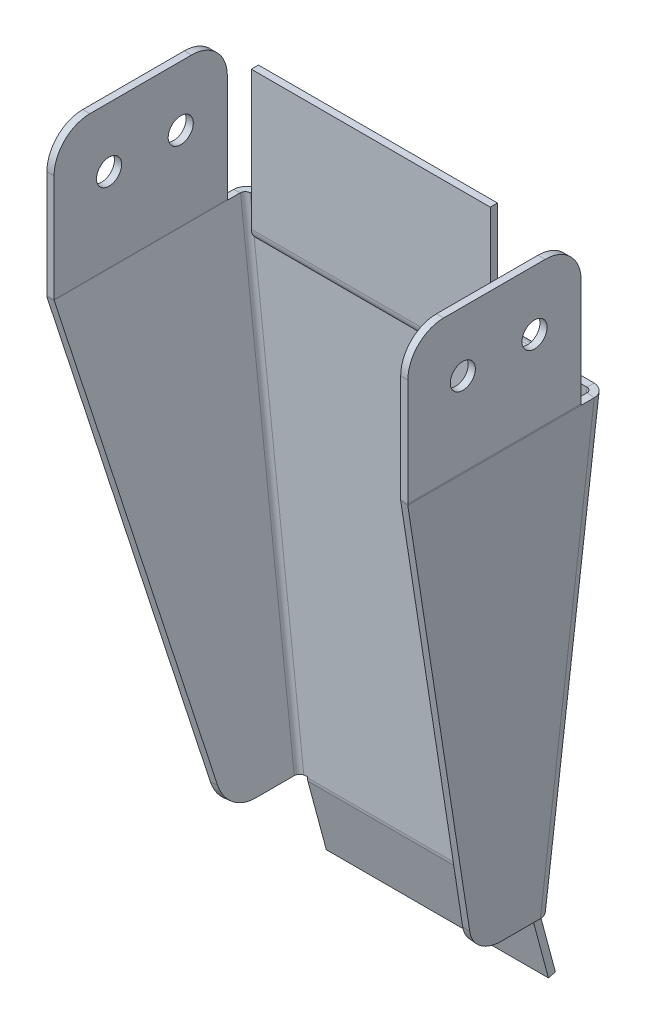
ISO-10303-21;
HEADER;
FILE_DESCRIPTION(('STEP AP214'),'2;1');
FILE_NAME('part.step','',(''),(''),'','','');
FILE_SCHEMA(('AUTOMOTIVE_DESIGN { 1 0 10303 214 1 1 1 1 }'));
ENDSEC;
DATA;
#1=APPLICATION_CONTEXT('core data for automotive mechanical design processes');
#2=APPLICATION_PROTOCOL_DEFINITION('international standard','automotive_design',2000,#1);
#3=PRODUCT_CONTEXT('',#1,'mechanical');
#4=PRODUCT('Part','Part','',(#3));
#5=PRODUCT_RELATED_PRODUCT_CATEGORY('part','',(#4));
#6=PRODUCT_DEFINITION_FORMATION('','',#4);
#7=PRODUCT_DEFINITION_CONTEXT('part definition',#1,'design');
#8=PRODUCT_DEFINITION('design','',#6,#7);
#9=PRODUCT_DEFINITION_SHAPE('','',#8);
#10=(LENGTH_UNIT() NAMED_UNIT(*) SI_UNIT(.MILLI.,.METRE.));
#11=(NAMED_UNIT(*) PLANE_ANGLE_UNIT() SI_UNIT($,.RADIAN.));
#12=(NAMED_UNIT(*) SI_UNIT($,.STERADIAN.) SOLID_ANGLE_UNIT());
#13=UNCERTAINTY_MEASURE_WITH_UNIT(LENGTH_MEASURE(1.E-05),#10,'distance_accuracy_value','');
#14=(GEOMETRIC_REPRESENTATION_CONTEXT(3) GLOBAL_UNCERTAINTY_ASSIGNED_CONTEXT((#13)) GLOBAL_UNIT_ASSIGNED_CONTEXT((#10,
#11,#12)) REPRESENTATION_CONTEXT('',''));
#15=CARTESIAN_POINT('',(0.,0.,0.));
#16=DIRECTION('',(0.,0.,1.));
#17=DIRECTION('',(1.,0.,0.));
#18=AXIS2_PLACEMENT_3D('',#15,#16,#17);
#19=CARTESIAN_POINT('',(-72.5,0.,3.));
#20=DIRECTION('',(0.,-1.,0.));
#21=DIRECTION('',(1.,0.,0.));
#22=AXIS2_PLACEMENT_3D('',#19,#20,#21);
#23=PLANE('',#22);
#24=DIRECTION('',(0.,0.,-1.));
#25=VECTOR('',#24,1.);
#26=CARTESIAN_POINT('',(50.,0.,3.00000000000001));
#27=LINE('',#26,#25);
#28=CARTESIAN_POINT('',(50.,0.,3.00000000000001));
#29=VERTEX_POINT('',#28);
#30=CARTESIAN_POINT('',(50.,0.,0.));
#31=VERTEX_POINT('',#30);
#32=EDGE_CURVE('E564',#29,#31,#27,.T.);
#33=ORIENTED_EDGE('',*,*,#32,.F.);
#34=DIRECTION('',(-1.,0.,0.));
#35=VECTOR('',#34,1.);
#36=CARTESIAN_POINT('',(-72.5,0.,3.));
#37=LINE('',#36,#35);
#38=CARTESIAN_POINT('',(70.4873835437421,0.,3.));
#39=VERTEX_POINT('',#38);
#40=EDGE_CURVE('E954',#39,#29,#37,.T.);
#41=ORIENTED_EDGE('',*,*,#40,.F.);
#42=DIRECTION('',(0.,0.,-1.));
#43=VECTOR('',#42,1.);
#44=CARTESIAN_POINT('',(70.4873835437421,0.,3.00000000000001));
#45=LINE('',#44,#43);
#46=CARTESIAN_POINT('',(70.4873835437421,0.,0.));
#47=VERTEX_POINT('',#46);
#48=EDGE_CURVE('E802',#39,#47,#45,.T.);
#49=ORIENTED_EDGE('',*,*,#48,.T.);
#50=DIRECTION('',(-1.,0.,0.));
#51=VECTOR('',#50,1.);
#52=CARTESIAN_POINT('',(-72.5,0.,0.));
#53=LINE('',#52,#51);
#54=EDGE_CURVE('E946',#47,#31,#53,.T.);
#55=ORIENTED_EDGE('',*,*,#54,.T.);
#56=EDGE_LOOP('',(#33,#41,#49,#55));
#57=FACE_BOUND('',#56,.T.);
#58=ADVANCED_FACE('F135',(#57),#23,.F.);
#59=CARTESIAN_POINT('',(75.4811939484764,-0.335384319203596,2.99999999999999));
#60=DIRECTION('',(0.111794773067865,0.993731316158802,0.));
#61=DIRECTION('',(-0.993731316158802,0.111794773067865,0.));
#62=AXIS2_PLACEMENT_3D('',#59,#60,#61);
#63=PLANE('',#62);
#64=DIRECTION('',(0.,0.,-1.));
#65=VECTOR('',#64,1.);
#66=CARTESIAN_POINT('',(72.5,0.,3.));
#67=LINE('',#66,#65);
#68=CARTESIAN_POINT('',(72.5000000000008,0.,10.5));
#69=VERTEX_POINT('',#68);
#70=CARTESIAN_POINT('',(72.5,0.,4.99999999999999));
#71=VERTEX_POINT('',#70);
#72=EDGE_CURVE('E744',#69,#71,#67,.T.);
#73=ORIENTED_EDGE('',*,*,#72,.F.);
#74=DIRECTION('',(0.993731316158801,-0.111794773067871,0.));
#75=VECTOR('',#74,1.);
#76=CARTESIAN_POINT('',(72.5000000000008,0.,10.5));
#77=LINE('',#76,#75);
#78=CARTESIAN_POINT('',(75.4811939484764,-0.335384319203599,10.5));
#79=VERTEX_POINT('',#78);
#80=EDGE_CURVE('E755',#69,#79,#77,.T.);
#81=ORIENTED_EDGE('',*,*,#80,.T.);
#82=DIRECTION('',(0.,0.,-1.));
#83=VECTOR('',#82,1.);
#84=CARTESIAN_POINT('',(75.4811939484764,-0.335384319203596,2.99999999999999));
#85=LINE('',#84,#83);
#86=CARTESIAN_POINT('',(75.4811939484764,-0.335384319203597,4.99999999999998));
#87=VERTEX_POINT('',#86);
#88=EDGE_CURVE('E721',#79,#87,#85,.T.);
#89=ORIENTED_EDGE('',*,*,#88,.T.);
#90=DIRECTION('',(0.993731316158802,-0.111794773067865,0.));
#91=VECTOR('',#90,1.);
#92=CARTESIAN_POINT('',(72.5,0.,4.99999999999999));
#93=LINE('',#92,#91);
#94=EDGE_CURVE('E769',#71,#87,#93,.T.);
#95=ORIENTED_EDGE('',*,*,#94,.F.);
#96=EDGE_LOOP('',(#73,#81,#89,#95));
#97=FACE_BOUND('',#96,.T.);
#98=ADVANCED_FACE('F1089',(#97),#63,.T.);
#99=CARTESIAN_POINT('',(-50.,0.,3.00000000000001));
#100=VERTEX_POINT('',#99);
#101=CARTESIAN_POINT('',(-70.4873835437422,0.,3.));
#102=VERTEX_POINT('',#101);
#103=EDGE_CURVE('E945',#100,#102,#37,.T.);
#104=ORIENTED_EDGE('',*,*,#103,.F.);
#105=DIRECTION('',(0.,0.,-1.));
#106=VECTOR('',#105,1.);
#107=CARTESIAN_POINT('',(-50.,0.,3.00000000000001));
#108=LINE('',#107,#106);
#109=CARTESIAN_POINT('',(-50.,0.,0.));
#110=VERTEX_POINT('',#109);
#111=EDGE_CURVE('E568',#100,#110,#108,.T.);
#112=ORIENTED_EDGE('',*,*,#111,.T.);
#113=CARTESIAN_POINT('',(-70.4873835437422,0.,0.));
#114=VERTEX_POINT('',#113);
#115=EDGE_CURVE('E958',#110,#114,#53,.T.);
#116=ORIENTED_EDGE('',*,*,#115,.T.);
#117=DIRECTION('',(0.,0.,-1.));
#118=VECTOR('',#117,1.);
#119=CARTESIAN_POINT('',(-70.4873835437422,0.,3.00000000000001));
#120=LINE('',#119,#118);
#121=EDGE_CURVE('E926',#102,#114,#120,.T.);
#122=ORIENTED_EDGE('',*,*,#121,.F.);
#123=EDGE_LOOP('',(#104,#112,#116,#122));
#124=FACE_BOUND('',#123,.T.);
#125=ADVANCED_FACE('F1041',(#124),#23,.F.);
#126=CARTESIAN_POINT('',(-72.5,0.,3.));
#127=DIRECTION('',(0.,0.,1.));
#128=DIRECTION('',(1.,0.,0.));
#129=AXIS2_PLACEMENT_3D('',#126,#127,#128);
#130=PLANE('',#129);
#131=DIRECTION('',(-0.993731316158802,0.111794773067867,0.));
#132=VECTOR('',#131,1.);
#133=CARTESIAN_POINT('',(48.0125373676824,-199.776410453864,3.00000000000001));
#134=LINE('',#133,#132);
#135=CARTESIAN_POINT('',(48.0125373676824,-199.776410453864,3.));
#136=VERTEX_POINT('',#135);
#137=CARTESIAN_POINT('',(46.5219403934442,-199.608718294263,3.));
#138=VERTEX_POINT('',#137);
#139=EDGE_CURVE('E1073',#136,#138,#134,.T.);
#140=ORIENTED_EDGE('',*,*,#139,.F.);
#141=DIRECTION('',(0.111794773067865,0.993731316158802,0.));
#142=VECTOR('',#141,1.);
#143=CARTESIAN_POINT('',(70.5125373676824,0.223589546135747,3.00000000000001));
#144=LINE('',#143,#142);
#145=EDGE_CURVE('E807',#39,#136,#144,.F.);
#146=ORIENTED_EDGE('',*,*,#145,.F.);
#147=ORIENTED_EDGE('',*,*,#40,.T.);
#148=DIRECTION('',(-1.,0.,0.));
#149=VECTOR('',#148,1.);
#150=CARTESIAN_POINT('',(-50.,0.,3.00000000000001));
#151=LINE('',#150,#149);
#152=EDGE_CURVE('E575',#100,#29,#151,.F.);
#153=ORIENTED_EDGE('',*,*,#152,.F.);
#154=ORIENTED_EDGE('',*,*,#103,.T.);
#155=DIRECTION('',(0.111794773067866,-0.993731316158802,0.));
#156=VECTOR('',#155,1.);
#157=CARTESIAN_POINT('',(-48.0125373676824,-199.776410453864,3.00000000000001));
#158=LINE('',#157,#156);
#159=CARTESIAN_POINT('',(-48.0125373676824,-199.776410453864,3.));
#160=VERTEX_POINT('',#159);
#161=EDGE_CURVE('E1017',#160,#102,#158,.F.);
#162=ORIENTED_EDGE('',*,*,#161,.F.);
#163=DIRECTION('',(-0.993731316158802,-0.111794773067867,0.));
#164=VECTOR('',#163,1.);
#165=CARTESIAN_POINT('',(-46.5219403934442,-199.608718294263,3.00000000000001));
#166=LINE('',#165,#164);
#167=CARTESIAN_POINT('',(-46.5219403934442,-199.608718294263,3.));
#168=VERTEX_POINT('',#167);
#169=EDGE_CURVE('E934',#168,#160,#166,.T.);
#170=ORIENTED_EDGE('',*,*,#169,.F.);
#171=DIRECTION('',(-0.111794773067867,0.993731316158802,0.));
#172=VECTOR('',#171,1.);
#173=CARTESIAN_POINT('',(-46.3542482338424,-201.099315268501,3.00000000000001));
#174=LINE('',#173,#172);
#175=CARTESIAN_POINT('',(-46.4779212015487,-200.,2.99999999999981));
#176=VERTEX_POINT('',#175);
#177=EDGE_CURVE('E930',#176,#168,#174,.T.);
#178=ORIENTED_EDGE('',*,*,#177,.F.);
#179=DIRECTION('',(1.,0.,0.));
#180=VECTOR('',#179,1.);
#181=CARTESIAN_POINT('',(50.,-200.,3.));
#182=LINE('',#181,#180);
#183=CARTESIAN_POINT('',(46.4779212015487,-200.,3.));
#184=VERTEX_POINT('',#183);
#185=EDGE_CURVE('E942',#176,#184,#182,.T.);
#186=ORIENTED_EDGE('',*,*,#185,.T.);
#187=DIRECTION('',(-0.111794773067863,-0.993731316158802,0.));
#188=VECTOR('',#187,1.);
#189=CARTESIAN_POINT('',(46.5219403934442,-199.608718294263,3.00000000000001));
#190=LINE('',#189,#188);
#191=EDGE_CURVE('E1065',#138,#184,#190,.T.);
#192=ORIENTED_EDGE('',*,*,#191,.F.);
#193=EDGE_LOOP('',(#140,#146,#147,#153,#154,#162,#170,#178,#186,#192));
#194=FACE_BOUND('',#193,.T.);
#195=ADVANCED_FACE('F1063',(#194),#130,.T.);
#196=CARTESIAN_POINT('',(-72.5,0.,0.));
#197=DIRECTION('',(0.,0.,1.));
#198=DIRECTION('',(1.,0.,0.));
#199=AXIS2_PLACEMENT_3D('',#196,#197,#198);
#200=PLANE('',#199);
#201=DIRECTION('',(0.111794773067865,0.993731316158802,0.));
#202=VECTOR('',#201,1.);
#203=CARTESIAN_POINT('',(70.5125373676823,0.223589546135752,0.));
#204=LINE('',#203,#202);
#205=CARTESIAN_POINT('',(48.0125373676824,-199.776410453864,0.));
#206=VERTEX_POINT('',#205);
#207=EDGE_CURVE('E803',#47,#206,#204,.F.);
#208=ORIENTED_EDGE('',*,*,#207,.T.);
#209=DIRECTION('',(0.993731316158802,-0.111794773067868,0.));
#210=VECTOR('',#209,1.);
#211=CARTESIAN_POINT('',(-93.1877796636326,-183.891374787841,0.));
#212=LINE('',#211,#210);
#213=CARTESIAN_POINT('',(46.5219403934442,-199.608718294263,0.));
#214=VERTEX_POINT('',#213);
#215=EDGE_CURVE('E597',#214,#206,#212,.T.);
#216=ORIENTED_EDGE('',*,*,#215,.F.);
#217=DIRECTION('',(0.111794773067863,0.993731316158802,0.));
#218=VECTOR('',#217,1.);
#219=CARTESIAN_POINT('',(67.2097200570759,-15.7173435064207,0.));
#220=LINE('',#219,#218);
#221=CARTESIAN_POINT('',(46.4779212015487,-200.,0.));
#222=VERTEX_POINT('',#221);
#223=EDGE_CURVE('E715',#222,#214,#220,.T.);
#224=ORIENTED_EDGE('',*,*,#223,.F.);
#225=DIRECTION('',(1.,0.,0.));
#226=VECTOR('',#225,1.);
#227=CARTESIAN_POINT('',(50.,-200.,0.));
#228=LINE('',#227,#226);
#229=CARTESIAN_POINT('',(-46.4779212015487,-200.,-1.93855348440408E-13));
#230=VERTEX_POINT('',#229);
#231=EDGE_CURVE('E941',#230,#222,#228,.T.);
#232=ORIENTED_EDGE('',*,*,#231,.F.);
#233=DIRECTION('',(0.111794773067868,-0.993731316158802,0.));
#234=VECTOR('',#233,1.);
#235=CARTESIAN_POINT('',(-69.0219403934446,0.391281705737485,0.));
#236=LINE('',#235,#234);
#237=CARTESIAN_POINT('',(-46.5219403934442,-199.608718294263,0.));
#238=VERTEX_POINT('',#237);
#239=EDGE_CURVE('E718',#238,#230,#236,.T.);
#240=ORIENTED_EDGE('',*,*,#239,.F.);
#241=DIRECTION('',(0.993731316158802,0.111794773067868,0.));
#242=VECTOR('',#241,1.);
#243=CARTESIAN_POINT('',(-49.9999999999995,-200.,0.));
#244=LINE('',#243,#242);
#245=CARTESIAN_POINT('',(-48.0125373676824,-199.776410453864,0.));
#246=VERTEX_POINT('',#245);
#247=EDGE_CURVE('E957',#246,#238,#244,.T.);
#248=ORIENTED_EDGE('',*,*,#247,.F.);
#249=DIRECTION('',(0.111794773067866,-0.993731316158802,0.));
#250=VECTOR('',#249,1.);
#251=CARTESIAN_POINT('',(-48.0125373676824,-199.776410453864,0.));
#252=LINE('',#251,#250);
#253=EDGE_CURVE('E918',#246,#114,#252,.F.);
#254=ORIENTED_EDGE('',*,*,#253,.T.);
#255=ORIENTED_EDGE('',*,*,#115,.F.);
#256=DIRECTION('',(-1.,0.,0.));
#257=VECTOR('',#256,1.);
#258=CARTESIAN_POINT('',(-50.,0.,0.));
#259=LINE('',#258,#257);
#260=EDGE_CURVE('E581',#110,#31,#259,.F.);
#261=ORIENTED_EDGE('',*,*,#260,.T.);
#262=ORIENTED_EDGE('',*,*,#54,.F.);
#263=EDGE_LOOP('',(#208,#216,#224,#232,#240,#248,#254,#255,#261,#262));
#264=FACE_BOUND('',#263,.T.);
#265=ADVANCED_FACE('F893',(#264),#200,.F.);
#266=CARTESIAN_POINT('',(-75.4811939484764,-0.335384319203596,2.99999999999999));
#267=DIRECTION('',(0.111794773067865,-0.993731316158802,0.));
#268=DIRECTION('',(0.993731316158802,0.111794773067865,0.));
#269=AXIS2_PLACEMENT_3D('',#266,#267,#268);
#270=PLANE('',#269);
#271=DIRECTION('',(-0.993731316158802,-0.111794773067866,0.));
#272=VECTOR('',#271,1.);
#273=CARTESIAN_POINT('',(-72.5,0.,10.5));
#274=LINE('',#273,#272);
#275=CARTESIAN_POINT('',(-72.5,0.,10.5));
#276=VERTEX_POINT('',#275);
#277=CARTESIAN_POINT('',(-75.4811939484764,-0.335384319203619,10.5));
#278=VERTEX_POINT('',#277);
#279=EDGE_CURVE('E699',#276,#278,#274,.T.);
#280=ORIENTED_EDGE('',*,*,#279,.F.);
#281=DIRECTION('',(0.,0.,-1.));
#282=VECTOR('',#281,1.);
#283=CARTESIAN_POINT('',(-72.5,0.,3.));
#284=LINE('',#283,#282);
#285=CARTESIAN_POINT('',(-72.5,0.,4.99999999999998));
#286=VERTEX_POINT('',#285);
#287=EDGE_CURVE('E982',#276,#286,#284,.T.);
#288=ORIENTED_EDGE('',*,*,#287,.T.);
#289=DIRECTION('',(-0.993731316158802,-0.111794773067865,0.));
#290=VECTOR('',#289,1.);
#291=CARTESIAN_POINT('',(-72.5,0.,4.99999999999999));
#292=LINE('',#291,#290);
#293=CARTESIAN_POINT('',(-75.4811939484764,-0.335384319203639,4.99999999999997));
#294=VERTEX_POINT('',#293);
#295=EDGE_CURVE('E703',#286,#294,#292,.T.);
#296=ORIENTED_EDGE('',*,*,#295,.T.);
#297=DIRECTION('',(0.,0.,-1.));
#298=VECTOR('',#297,1.);
#299=CARTESIAN_POINT('',(-75.4811939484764,-0.335384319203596,2.99999999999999));
#300=LINE('',#299,#298);
#301=EDGE_CURVE('E967',#278,#294,#300,.T.);
#302=ORIENTED_EDGE('',*,*,#301,.F.);
#303=EDGE_LOOP('',(#280,#288,#296,#302));
#304=FACE_BOUND('',#303,.T.);
#305=ADVANCED_FACE('F889',(#304),#270,.F.);
#306=CARTESIAN_POINT('',(-46.3542482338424,-201.099315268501,3.00000000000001));
#307=DIRECTION('',(-0.993731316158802,-0.111794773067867,0.));
#308=DIRECTION('',(0.111794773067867,-0.993731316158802,0.));
#309=AXIS2_PLACEMENT_3D('',#306,#307,#308);
#310=PLANE('',#309);
#311=ORIENTED_EDGE('',*,*,#239,.T.);
#312=DIRECTION('',(0.,0.,1.));
#313=VECTOR('',#312,1.);
#314=CARTESIAN_POINT('',(-46.4779212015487,-200.,2.99999999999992));
#315=LINE('',#314,#313);
#316=EDGE_CURVE('E933',#230,#176,#315,.T.);
#317=ORIENTED_EDGE('',*,*,#316,.T.);
#318=ORIENTED_EDGE('',*,*,#177,.T.);
#319=DIRECTION('',(0.,0.,-1.));
#320=VECTOR('',#319,1.);
#321=CARTESIAN_POINT('',(-46.5219403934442,-199.608718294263,3.00000000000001));
#322=LINE('',#321,#320);
#323=EDGE_CURVE('E929',#168,#238,#322,.T.);
#324=ORIENTED_EDGE('',*,*,#323,.T.);
#325=EDGE_LOOP('',(#311,#317,#318,#324));
#326=FACE_BOUND('',#325,.T.);
#327=ADVANCED_FACE('F892',(#326),#310,.T.);
#328=CARTESIAN_POINT('',(-46.5219403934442,-199.608718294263,3.00000000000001));
#329=DIRECTION('',(0.111794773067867,-0.993731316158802,0.));
#330=DIRECTION('',(0.993731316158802,0.111794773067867,0.));
#331=AXIS2_PLACEMENT_3D('',#328,#329,#330);
#332=PLANE('',#331);
#333=DIRECTION('',(0.,0.,-1.));
#334=VECTOR('',#333,1.);
#335=CARTESIAN_POINT('',(-48.0125373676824,-199.776410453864,3.00000000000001));
#336=LINE('',#335,#334);
#337=EDGE_CURVE('E917',#160,#246,#336,.T.);
#338=ORIENTED_EDGE('',*,*,#337,.T.);
#339=ORIENTED_EDGE('',*,*,#247,.T.);
#340=ORIENTED_EDGE('',*,*,#323,.F.);
#341=ORIENTED_EDGE('',*,*,#169,.T.);
#342=EDGE_LOOP('',(#338,#339,#340,#341));
#343=FACE_BOUND('',#342,.T.);
#344=ADVANCED_FACE('F1060',(#343),#332,.T.);
#345=CARTESIAN_POINT('',(-70.4873835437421,0.,-0.0299999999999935));
#346=CARTESIAN_POINT('',(-71.1438959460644,-0.0549859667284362,-0.0300000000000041));
#347=CARTESIAN_POINT('',(-71.7999144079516,-0.10992316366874,0.10091743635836));
#348=CARTESIAN_POINT('',(-73.013091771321,-0.208669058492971,0.604854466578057));
#349=CARTESIAN_POINT('',(-73.5696567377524,-0.252414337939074,0.977675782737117));
#350=CARTESIAN_POINT('',(-74.4991661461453,-0.319247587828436,1.90882999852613));
#351=CARTESIAN_POINT('',(-74.8717465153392,-0.342294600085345,2.46679652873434));
#352=CARTESIAN_POINT('',(-75.3767168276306,-0.361367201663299,3.68340814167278));
#353=CARTESIAN_POINT('',(-75.5089093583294,-0.357373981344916,4.34145592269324));
#354=CARTESIAN_POINT('',(-75.5110058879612,-0.338738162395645,4.99999999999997));
#355=CARTESIAN_POINT('',(-70.4873835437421,0.,0.));
#356=CARTESIAN_POINT('',(-71.1399928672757,-0.0545468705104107,0.));
#357=CARTESIAN_POINT('',(-71.7921111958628,-0.109045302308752,0.13013661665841));
#358=CARTESIAN_POINT('',(-72.9980779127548,-0.206979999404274,0.631068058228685));
#359=CARTESIAN_POINT('',(-73.5513359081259,-0.250353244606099,1.00166578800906));
#360=CARTESIAN_POINT('',(-74.4753265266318,-0.316565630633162,1.92726640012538));
#361=CARTESIAN_POINT('',(-74.8456972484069,-0.33936405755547,2.48190509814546));
#362=CARTESIAN_POINT('',(-75.3476808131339,-0.358100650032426,3.69126057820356));
#363=CARTESIAN_POINT('',(-75.4790974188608,-0.354020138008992,4.34538362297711));
#364=CARTESIAN_POINT('',(-75.4811939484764,-0.335384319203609,4.99999999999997));
#365=CARTESIAN_POINT('',(-70.4873835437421,0.,3.00000000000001));
#366=CARTESIAN_POINT('',(-70.7496849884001,-0.0106372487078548,3.));
#367=CARTESIAN_POINT('',(-71.0117899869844,-0.0212591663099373,3.05205464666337));
#368=CARTESIAN_POINT('',(-71.4966920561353,-0.0380740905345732,3.25242722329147));
#369=CARTESIAN_POINT('',(-71.7192529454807,-0.0442439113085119,3.40066631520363));
#370=CARTESIAN_POINT('',(-72.0913645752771,-0.0483699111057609,3.77090656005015));
#371=CARTESIAN_POINT('',(-72.2407705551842,-0.0463098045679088,3.99276203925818));
#372=CARTESIAN_POINT('',(-72.444079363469,-0.0314454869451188,4.47650423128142));
#373=CARTESIAN_POINT('',(-72.4979034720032,-0.018635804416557,4.73815365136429));
#374=CARTESIAN_POINT('',(-72.5,0.,4.99999999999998));
#375=CARTESIAN_POINT('',(-70.4873835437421,0.,3.03030000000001));
#376=CARTESIAN_POINT('',(-70.7457428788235,-0.010193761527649,3.0303));
#377=CARTESIAN_POINT('',(-71.0039087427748,-0.0203725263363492,3.08156601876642));
#378=CARTESIAN_POINT('',(-71.4815280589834,-0.0363681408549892,3.27890295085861));
#379=CARTESIAN_POINT('',(-71.700748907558,-0.0421622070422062,3.42489622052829));
#380=CARTESIAN_POINT('',(-72.0672865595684,-0.0456611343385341,3.78952732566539));
#381=CARTESIAN_POINT('',(-72.2144607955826,-0.0433499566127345,4.00802169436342));
#382=CARTESIAN_POINT('',(-72.4147529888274,-0.028146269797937,4.48443519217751));
#383=CARTESIAN_POINT('',(-72.4677934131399,-0.0152484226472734,4.742120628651));
#384=CARTESIAN_POINT('',(-72.4698899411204,0.00338738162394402,4.99999999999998));
#385=B_SPLINE_SURFACE_WITH_KNOTS('',1,3,((#345,#346,#347,#348,#349,#350,#351,#352,#353,#354),
(#355,#356,#357,#358,#359,#360,#361,#362,#363,#364),(#365,#366,#367,#368,#369,#370,#371,#372,
#373,#374),(#375,#376,#377,#378,#379,#380,#381,#382,#383,#384)),.UNSPECIFIED.,.F.,.F.,.F.,(2,1,
1,2),(4,2,2,2,4),(-0.01,0.,1.,1.0101),(0.,0.25,0.5,0.75,1.),.UNSPECIFIED.);
#386=CARTESIAN_POINT('',(-70.4873835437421,0.,3.00000000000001));
#387=CARTESIAN_POINT('',(-70.5201653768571,-0.00132942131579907,2.99999930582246));
#388=CARTESIAN_POINT('',(-70.5529471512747,-0.00265883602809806,3.0008031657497));
#389=CARTESIAN_POINT('',(-70.6184323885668,-0.00530885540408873,3.00401500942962));
#390=CARTESIAN_POINT('',(-70.6511358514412,-0.00662946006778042,3.0064229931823));
#391=CARTESIAN_POINT('',(-70.7163862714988,-0.00925306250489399,3.01283810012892));
#392=CARTESIAN_POINT('',(-70.7489332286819,-0.0105560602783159,3.01684522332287));
#393=CARTESIAN_POINT('',(-70.8137928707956,-0.0131357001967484,3.02644873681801));
#394=CARTESIAN_POINT('',(-70.8461055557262,-0.0144123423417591,3.03204512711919));
#395=CARTESIAN_POINT('',(-70.9104194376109,-0.0169305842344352,3.04481375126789));
#396=CARTESIAN_POINT('',(-70.9424206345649,-0.0181721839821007,3.0519859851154));
#397=CARTESIAN_POINT('',(-71.0060350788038,-0.0206117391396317,3.06788900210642));
#398=CARTESIAN_POINT('',(-71.0376483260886,-0.0218096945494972,3.07661978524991));
#399=CARTESIAN_POINT('',(-71.1004113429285,-0.0241534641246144,3.09561887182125));
#400=CARTESIAN_POINT('',(-71.1315611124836,-0.025299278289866,3.1058871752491));
#401=CARTESIAN_POINT('',(-71.1933227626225,-0.0275303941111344,3.12793656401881));
#402=CARTESIAN_POINT('',(-71.2239346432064,-0.0286156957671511,3.13971764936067));
#403=CARTESIAN_POINT('',(-71.2845473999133,-0.0307175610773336,3.16476422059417));
#404=CARTESIAN_POINT('',(-71.3145482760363,-0.0317341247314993,3.1780297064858));
#405=CARTESIAN_POINT('',(-71.3738673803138,-0.0336904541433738,3.20601312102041));
#406=CARTESIAN_POINT('',(-71.4031856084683,-0.0346302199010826,3.22073104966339));
#407=CARTESIAN_POINT('',(-71.4610694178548,-0.0364250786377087,3.25158389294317));
#408=CARTESIAN_POINT('',(-71.4896349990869,-0.037280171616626,3.26771880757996));
#409=CARTESIAN_POINT('',(-71.5459453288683,-0.0388980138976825,3.30136675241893));
#410=CARTESIAN_POINT('',(-71.5736900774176,-0.0396607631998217,3.31887978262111));
#411=CARTESIAN_POINT('',(-71.6282925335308,-0.0410864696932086,3.35524176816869));
#412=CARTESIAN_POINT('',(-71.6551502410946,-0.0417494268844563,3.37409072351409));
#413=CARTESIAN_POINT('',(-71.7079145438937,-0.0429683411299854,3.4130791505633));
#414=CARTESIAN_POINT('',(-71.7338211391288,-0.0435242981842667,3.43321862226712));
#415=CARTESIAN_POINT('',(-71.7846214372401,-0.0445222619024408,3.47473956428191));
#416=CARTESIAN_POINT('',(-71.8095151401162,-0.0449642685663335,3.4961210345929));
#417=CARTESIAN_POINT('',(-71.8582303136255,-0.0457276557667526,3.54007446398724));
#418=CARTESIAN_POINT('',(-71.8820517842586,-0.046049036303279,3.56264642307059));
#419=CARTESIAN_POINT('',(-71.9285657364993,-0.0465647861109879,3.60892645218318));
#420=CARTESIAN_POINT('',(-71.9512582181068,-0.0467591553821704,3.63263452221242));
#421=CARTESIAN_POINT('',(-71.9954601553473,-0.0470148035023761,3.68112965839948));
#422=CARTESIAN_POINT('',(-72.0169696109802,-0.0470760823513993,3.7059167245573));
#423=CARTESIAN_POINT('',(-72.0587543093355,-0.0470597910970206,3.75651013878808));
#424=CARTESIAN_POINT('',(-72.0790295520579,-0.0469822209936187,3.78231648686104));
#425=CARTESIAN_POINT('',(-72.1182976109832,-0.0466828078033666,3.8348862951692));
#426=CARTESIAN_POINT('',(-72.1372904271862,-0.0464609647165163,3.8616497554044));
#427=CARTESIAN_POINT('',(-72.1739485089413,-0.0458679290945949,3.91606931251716));
#428=CARTESIAN_POINT('',(-72.1916137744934,-0.0454967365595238,3.94372540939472));
#429=CARTESIAN_POINT('',(-72.225574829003,-0.0446002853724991,3.99986361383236));
#430=CARTESIAN_POINT('',(-72.2418706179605,-0.0440750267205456,4.02834572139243));
#431=CARTESIAN_POINT('',(-72.2730540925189,-0.0428660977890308,4.08606733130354));
#432=CARTESIAN_POINT('',(-72.2879417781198,-0.0421824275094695,4.11530683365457));
#433=CARTESIAN_POINT('',(-72.3162738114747,-0.0406527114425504,4.17447279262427));
#434=CARTESIAN_POINT('',(-72.3297181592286,-0.0398066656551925,4.20439924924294));
#435=CARTESIAN_POINT('',(-72.3551317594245,-0.0379486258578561,4.26486702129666));
#436=CARTESIAN_POINT('',(-72.3671010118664,-0.0369366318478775,4.29540833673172));
#437=CARTESIAN_POINT('',(-72.3895362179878,-0.0347435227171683,4.35703224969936));
#438=CARTESIAN_POINT('',(-72.4000021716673,-0.0335624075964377,4.38811484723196));
#439=CARTESIAN_POINT('',(-72.4194061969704,-0.0310282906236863,4.45074644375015));
#440=CARTESIAN_POINT('',(-72.4283442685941,-0.0296752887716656,4.48229544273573));
#441=CARTESIAN_POINT('',(-72.4446716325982,-0.0267950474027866,4.54578383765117));
#442=CARTESIAN_POINT('',(-72.4520609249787,-0.0252678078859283,4.57772323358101));
#443=CARTESIAN_POINT('',(-72.4652735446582,-0.0220371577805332,4.64191547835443));
#444=CARTESIAN_POINT('',(-72.4710968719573,-0.0203337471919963,4.674168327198));
#445=CARTESIAN_POINT('',(-72.4811642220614,-0.016749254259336,4.73890977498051));
#446=CARTESIAN_POINT('',(-72.4854082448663,-0.0148681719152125,4.77139837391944));
#447=CARTESIAN_POINT('',(-72.4923071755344,-0.0109272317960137,4.83653306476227));
#448=CARTESIAN_POINT('',(-72.4949620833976,-0.0088673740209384,4.86917915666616));
#449=CARTESIAN_POINT('',(-72.4986778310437,-0.00456832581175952,4.93455014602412));
#450=CARTESIAN_POINT('',(-72.4997386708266,-0.00232913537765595,4.9672750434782));
#451=CARTESIAN_POINT('',(-72.5,0.,4.99999999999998));
#452=B_SPLINE_CURVE_WITH_KNOTS('',3,(#386,#387,#388,#389,#390,#391,#392,#393,#394,#395,#396,
#397,#398,#399,#400,#401,#402,#403,#404,#405,#406,#407,#408,#409,#410,#411,#412,#413,#414,#415,
#416,#417,#418,#419,#420,#421,#422,#423,#424,#425,#426,#427,#428,#429,#430,#431,#432,#433,#434,
#435,#436,#437,#438,#439,#440,#441,#442,#443,#444,#445,#446,#447,#448,#449,#450,#451),
.UNSPECIFIED.,.F.,.F.,(4,2,2,2,2,2,2,2,2,2,2,2,2,2,2,2,2,2,2,2,2,2,2,2,2,2,2,2,2,2,2,2,4),(0.,
0.0984164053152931,0.196832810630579,0.295249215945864,0.393665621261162,0.492082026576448,
0.590498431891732,0.688914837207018,0.787331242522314,0.885747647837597,0.984164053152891,
1.08258045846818,1.18099686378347,1.27941326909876,1.37782967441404,1.47624607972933,
1.57466248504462,1.67307889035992,1.77149529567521,1.86991170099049,1.96832810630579,
2.06674451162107,2.16516091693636,2.26357732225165,2.36199372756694,2.46041013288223,
2.55882653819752,2.65724294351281,2.7556593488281,2.85407575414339,2.95249215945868,
3.05090856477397,3.14932497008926),.UNSPECIFIED.);
#453=EDGE_CURVE('E1014',#102,#286,#452,.T.);
#454=CARTESIAN_POINT('',(-70.4873835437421,0.,0.));
#455=CARTESIAN_POINT('',(-70.5689450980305,-0.00681713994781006,-1.73544387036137E-06));
#456=CARTESIAN_POINT('',(-70.6505065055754,-0.013634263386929,0.00200791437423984));
#457=CARTESIAN_POINT('',(-70.8134335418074,-0.0272464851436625,0.0100375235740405));
#458=CARTESIAN_POINT('',(-70.8947991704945,-0.034041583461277,0.0160574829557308));
#459=CARTESIAN_POINT('',(-71.0571391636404,-0.0475877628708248,0.0320952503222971));
#460=CARTESIAN_POINT('',(-71.1381135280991,-0.054338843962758,0.0421130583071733));
#461=CARTESIAN_POINT('',(-71.2994765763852,-0.0677751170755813,0.0661218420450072));
#462=CARTESIAN_POINT('',(-71.3798652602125,-0.0744603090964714,0.0801128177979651));
#463=CARTESIAN_POINT('',(-71.539863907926,-0.0877430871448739,0.112034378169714));
#464=CARTESIAN_POINT('',(-71.6194738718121,-0.0943406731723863,0.129964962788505));
#465=CARTESIAN_POINT('',(-71.7777239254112,-0.107426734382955,0.16972250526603));
#466=CARTESIAN_POINT('',(-71.8563640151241,-0.113915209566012,0.191549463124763));
#467=CARTESIAN_POINT('',(-72.0124855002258,-0.126761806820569,0.239047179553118));
#468=CARTESIAN_POINT('',(-72.0899668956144,-0.133119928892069,0.264717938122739));
#469=CARTESIAN_POINT('',(-72.2435849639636,-0.145684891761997,0.319841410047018));
#470=CARTESIAN_POINT('',(-72.3197216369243,-0.151891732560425,0.349294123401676));
#471=CARTESIAN_POINT('',(-72.4704674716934,-0.164133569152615,0.411910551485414));
#472=CARTESIAN_POINT('',(-72.5450766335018,-0.170168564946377,0.445074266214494));
#473=CARTESIAN_POINT('',(-72.6925883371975,-0.182046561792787,0.515032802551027));
#474=CARTESIAN_POINT('',(-72.7654908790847,-0.187889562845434,0.551827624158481));
#475=CARTESIAN_POINT('',(-72.9094143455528,-0.199363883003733,0.628959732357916));
#476=CARTESIAN_POINT('',(-72.9804352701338,-0.204995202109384,0.669297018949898));
#477=CARTESIAN_POINT('',(-73.1204250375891,-0.216026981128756,0.753416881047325));
#478=CARTESIAN_POINT('',(-73.1893938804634,-0.221427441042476,0.79719945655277));
#479=CARTESIAN_POINT('',(-73.3251139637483,-0.231978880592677,0.88810442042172));
#480=CARTESIAN_POINT('',(-73.3918652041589,-0.237129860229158,0.935226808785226));
#481=CARTESIAN_POINT('',(-73.5229899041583,-0.24716431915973,1.03269787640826));
#482=CARTESIAN_POINT('',(-73.5873633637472,-0.25204779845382,1.08304655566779));
#483=CARTESIAN_POINT('',(-73.7135780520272,-0.261529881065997,1.18684891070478));
#484=CARTESIAN_POINT('',(-73.7754192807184,-0.266128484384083,1.24030258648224));
#485=CARTESIAN_POINT('',(-73.8964211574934,-0.275024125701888,1.3501861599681));
#486=CARTESIAN_POINT('',(-73.9555818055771,-0.279321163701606,1.40661605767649));
#487=CARTESIAN_POINT('',(-74.0710806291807,-0.287597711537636,1.52231613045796));
#488=CARTESIAN_POINT('',(-74.1274188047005,-0.291577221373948,1.58158630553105));
#489=CARTESIAN_POINT('',(-74.2371375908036,-0.299203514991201,1.7028241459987));
#490=CARTESIAN_POINT('',(-74.2905182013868,-0.302850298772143,1.76479181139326));
#491=CARTESIAN_POINT('',(-74.3941938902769,-0.309796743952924,1.89127534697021));
#492=CARTESIAN_POINT('',(-74.4444889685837,-0.313096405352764,1.9557912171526));
#493=CARTESIAN_POINT('',(-74.5418730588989,-0.319335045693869,2.08721573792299));
#494=CARTESIAN_POINT('',(-74.5889620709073,-0.322274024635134,2.154124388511));
#495=CARTESIAN_POINT('',(-74.6798212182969,-0.327778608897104,2.2901732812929));
#496=CARTESIAN_POINT('',(-74.7235913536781,-0.330344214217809,2.3593135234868));
#497=CARTESIAN_POINT('',(-74.807707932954,-0.335090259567,2.4996590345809));
#498=CARTESIAN_POINT('',(-74.8480543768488,-0.337270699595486,2.57086430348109));
#499=CARTESIAN_POINT('',(-74.9252270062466,-0.341235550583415,2.71516832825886));
#500=CARTESIAN_POINT('',(-74.9620531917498,-0.34301996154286,2.78826708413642));
#501=CARTESIAN_POINT('',(-75.0320972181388,-0.346182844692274,2.93618198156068));
#502=CARTESIAN_POINT('',(-75.0653150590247,-0.347561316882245,3.01099812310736));
#503=CARTESIAN_POINT('',(-75.1280630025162,-0.349903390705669,3.16216755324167));
#504=CARTESIAN_POINT('',(-75.157593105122,-0.350866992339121,3.2385208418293));
#505=CARTESIAN_POINT('',(-75.2128950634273,-0.352371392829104,3.39258062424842));
#506=CARTESIAN_POINT('',(-75.2386669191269,-0.352912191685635,3.47028711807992));
#507=CARTESIAN_POINT('',(-75.2863909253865,-0.353564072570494,3.62686610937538));
#508=CARTESIAN_POINT('',(-75.3083430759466,-0.353675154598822,3.70573860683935));
#509=CARTESIAN_POINT('',(-75.3483754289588,-0.353461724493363,3.86445959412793));
#510=CARTESIAN_POINT('',(-75.3664556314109,-0.353137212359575,3.94430808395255));
#511=CARTESIAN_POINT('',(-75.3987011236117,-0.352047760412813,4.10478869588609));
#512=CARTESIAN_POINT('',(-75.4128664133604,-0.35128282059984,4.18542081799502));
#513=CARTESIAN_POINT('',(-75.4372487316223,-0.349308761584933,4.34727443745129));
#514=CARTESIAN_POINT('',(-75.4474657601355,-0.348099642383,4.42849593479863));
#515=CARTESIAN_POINT('',(-75.4639270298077,-0.345234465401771,4.59133266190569));
#516=CARTESIAN_POINT('',(-75.4701712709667,-0.343578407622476,4.67294789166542));
#517=CARTESIAN_POINT('',(-75.4786745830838,-0.339817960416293,4.83637536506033));
#518=CARTESIAN_POINT('',(-75.480933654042,-0.337713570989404,4.91818760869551));
#519=CARTESIAN_POINT('',(-75.4811939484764,-0.335384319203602,4.99999999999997));
#520=B_SPLINE_CURVE_WITH_KNOTS('',3,(#454,#455,#456,#457,#458,#459,#460,#461,#462,#463,#464,
#465,#466,#467,#468,#469,#470,#471,#472,#473,#474,#475,#476,#477,#478,#479,#480,#481,#482,#483,
#484,#485,#486,#487,#488,#489,#490,#491,#492,#493,#494,#495,#496,#497,#498,#499,#500,#501,#502,
#503,#504,#505,#506,#507,#508,#509,#510,#511,#512,#513,#514,#515,#516,#517,#518,#519),
.UNSPECIFIED.,.F.,.F.,(4,2,2,2,2,2,2,2,2,2,2,2,2,2,2,2,2,2,2,2,2,2,2,2,2,2,2,2,2,2,2,2,4),(0.,
0.245512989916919,0.491025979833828,0.736538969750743,0.982051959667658,1.22756494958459,
1.4730779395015,1.71859092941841,1.96410391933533,2.20961690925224,2.45512989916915,
2.70064288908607,2.94615587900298,3.1916688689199,3.43718185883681,3.68269484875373,
3.92820783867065,4.17372082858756,4.41923381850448,4.66474680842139,4.9102597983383,
5.15577278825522,5.40128577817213,5.64679876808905,5.89231175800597,6.13782474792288,
6.3833377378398,6.62885072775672,6.87436371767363,7.11987670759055,7.36538969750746,
7.61090268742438,7.85641567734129),.UNSPECIFIED.);
#521=EDGE_CURVE('E912',#114,#294,#520,.T.);
#522=ORIENTED_EDGE('',*,*,#295,.F.);
#523=ORIENTED_EDGE('',*,*,#453,.F.);
#524=ORIENTED_EDGE('',*,*,#121,.T.);
#525=ORIENTED_EDGE('',*,*,#521,.T.);
#526=EDGE_LOOP('',(#522,#523,#524,#525));
#527=FACE_BOUND('',#526,.T.);
#528=ADVANCED_FACE('F908',(#527),#385,.F.);
#529=CARTESIAN_POINT('',(-48.0125373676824,-199.776410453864,4.99999999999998));
#530=DIRECTION('',(-0.111794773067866,0.993731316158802,0.));
#531=DIRECTION('',(-0.993731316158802,-0.111794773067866,0.));
#532=AXIS2_PLACEMENT_3D('',#529,#530,#531);
#533=PLANE('',#532);
#534=CARTESIAN_POINT('',(-48.0125373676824,-199.776410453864,4.99999999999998));
#535=DIRECTION('',(0.111794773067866,-0.993731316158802,0.));
#536=DIRECTION('',(0.993731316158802,0.111794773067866,0.));
#537=AXIS2_PLACEMENT_3D('',#534,#535,#536);
#538=CIRCLE('',#537,1.99999999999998);
#539=CARTESIAN_POINT('',(-50.,-200.,4.99999999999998));
#540=VERTEX_POINT('',#539);
#541=EDGE_CURVE('E1012',#540,#160,#538,.T.);
#542=ORIENTED_EDGE('',*,*,#541,.F.);
#543=DIRECTION('',(-0.993731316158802,-0.111794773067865,0.));
#544=VECTOR('',#543,1.);
#545=CARTESIAN_POINT('',(-50.,-200.,4.99999999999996));
#546=LINE('',#545,#544);
#547=CARTESIAN_POINT('',(-52.9811939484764,-200.335384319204,4.99999999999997));
#548=VERTEX_POINT('',#547);
#549=EDGE_CURVE('E1001',#540,#548,#546,.T.);
#550=ORIENTED_EDGE('',*,*,#549,.T.);
#551=CARTESIAN_POINT('',(-48.0125373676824,-199.776410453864,4.99999999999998));
#552=DIRECTION('',(0.111794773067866,-0.993731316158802,0.));
#553=DIRECTION('',(0.993731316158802,0.111794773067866,0.));
#554=AXIS2_PLACEMENT_3D('',#551,#552,#553);
#555=CIRCLE('',#554,4.99999999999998);
#556=EDGE_CURVE('E1036',#548,#246,#555,.T.);
#557=ORIENTED_EDGE('',*,*,#556,.T.);
#558=ORIENTED_EDGE('',*,*,#337,.F.);
#559=EDGE_LOOP('',(#542,#550,#557,#558));
#560=FACE_BOUND('',#559,.T.);
#561=ADVANCED_FACE('F906',(#560),#533,.F.);
#562=CARTESIAN_POINT('',(-48.0125373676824,-199.776410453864,4.99999999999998));
#563=DIRECTION('',(0.111794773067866,-0.993731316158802,0.));
#564=DIRECTION('',(-0.993731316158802,-0.111794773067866,0.));
#565=AXIS2_PLACEMENT_3D('',#562,#563,#564);
#566=CYLINDRICAL_SURFACE('',#565,4.99999999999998);
#567=ORIENTED_EDGE('',*,*,#253,.F.);
#568=ORIENTED_EDGE('',*,*,#556,.F.);
#569=DIRECTION('',(0.111794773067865,-0.993731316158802,0.));
#570=VECTOR('',#569,1.);
#571=CARTESIAN_POINT('',(-75.4811939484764,-0.335384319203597,4.99999999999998));
#572=LINE('',#571,#570);
#573=EDGE_CURVE('E981',#294,#548,#572,.T.);
#574=ORIENTED_EDGE('',*,*,#573,.F.);
#575=ORIENTED_EDGE('',*,*,#521,.F.);
#576=EDGE_LOOP('',(#567,#568,#574,#575));
#577=FACE_BOUND('',#576,.T.);
#578=ADVANCED_FACE('F902',(#577),#566,.T.);
#579=CARTESIAN_POINT('',(-48.0125373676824,-199.776410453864,4.99999999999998));
#580=DIRECTION('',(0.111794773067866,-0.993731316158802,0.));
#581=DIRECTION('',(-0.993731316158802,-0.111794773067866,0.));
#582=AXIS2_PLACEMENT_3D('',#579,#580,#581);
#583=CYLINDRICAL_SURFACE('',#582,1.99999999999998);
#584=ORIENTED_EDGE('',*,*,#161,.T.);
#585=ORIENTED_EDGE('',*,*,#453,.T.);
#586=DIRECTION('',(0.111794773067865,-0.993731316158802,0.));
#587=VECTOR('',#586,1.);
#588=CARTESIAN_POINT('',(-72.5,0.,4.99999999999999));
#589=LINE('',#588,#587);
#590=EDGE_CURVE('E696',#286,#540,#589,.T.);
#591=ORIENTED_EDGE('',*,*,#590,.T.);
#592=ORIENTED_EDGE('',*,*,#541,.T.);
#593=EDGE_LOOP('',(#584,#585,#591,#592));
#594=FACE_BOUND('',#593,.T.);
#595=ADVANCED_FACE('F900',(#594),#583,.F.);
#596=CARTESIAN_POINT('',(-52.9811939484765,-200.335384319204,33.));
#597=DIRECTION('',(-0.111794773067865,0.993731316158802,0.));
#598=DIRECTION('',(-0.993731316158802,-0.111794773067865,0.));
#599=AXIS2_PLACEMENT_3D('',#596,#597,#598);
#600=PLANE('',#599);
#601=DIRECTION('',(0.,0.,1.));
#602=VECTOR('',#601,1.);
#603=CARTESIAN_POINT('',(-50.0000000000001,-200.,33.));
#604=LINE('',#603,#602);
#605=CARTESIAN_POINT('',(-50.,-200.,21.2705309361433));
#606=VERTEX_POINT('',#605);
#607=EDGE_CURVE('E976',#540,#606,#604,.T.);
#608=ORIENTED_EDGE('',*,*,#607,.T.);
#609=DIRECTION('',(0.993731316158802,0.111794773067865,0.));
#610=VECTOR('',#609,1.);
#611=CARTESIAN_POINT('',(-52.9811939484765,-200.335384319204,21.2705309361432));
#612=LINE('',#611,#610);
#613=CARTESIAN_POINT('',(-52.9811939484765,-200.335384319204,21.2705309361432));
#614=VERTEX_POINT('',#613);
#615=EDGE_CURVE('E599',#606,#614,#612,.F.);
#616=ORIENTED_EDGE('',*,*,#615,.T.);
#617=DIRECTION('',(0.,0.,1.));
#618=VECTOR('',#617,1.);
#619=CARTESIAN_POINT('',(-52.9811939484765,-200.335384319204,33.));
#620=LINE('',#619,#618);
#621=EDGE_CURVE('E992',#548,#614,#620,.T.);
#622=ORIENTED_EDGE('',*,*,#621,.F.);
#623=ORIENTED_EDGE('',*,*,#549,.F.);
#624=EDGE_LOOP('',(#608,#616,#622,#623));
#625=FACE_BOUND('',#624,.T.);
#626=ADVANCED_FACE('F884',(#625),#600,.F.);
#627=CARTESIAN_POINT('',(-75.4811939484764,-0.335384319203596,2.99999999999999));
#628=DIRECTION('',(-0.993731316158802,-0.111794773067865,0.));
#629=DIRECTION('',(0.111794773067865,-0.993731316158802,0.));
#630=AXIS2_PLACEMENT_3D('',#627,#628,#629);
#631=PLANE('',#630);
#632=ORIENTED_EDGE('',*,*,#621,.T.);
#633=CARTESIAN_POINT('',(-54.6581155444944,-185.429414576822,21.2705309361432));
#634=DIRECTION('',(-0.993731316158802,-0.111794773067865,0.));
#635=DIRECTION('',(0.111794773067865,-0.993731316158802,0.));
#636=AXIS2_PLACEMENT_3D('',#633,#634,#635);
#637=CIRCLE('',#636,15.);
#638=CARTESIAN_POINT('',(-54.2538032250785,-189.023301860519,35.8280206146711));
#639=VERTEX_POINT('',#638);
#640=EDGE_CURVE('E601',#614,#639,#637,.T.);
#641=ORIENTED_EDGE('',*,*,#640,.T.);
#642=DIRECTION('',(-0.108496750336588,0.964415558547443,0.241103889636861));
#643=VECTOR('',#642,1.);
#644=CARTESIAN_POINT('',(-75.4811939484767,-0.335384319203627,83.));
#645=LINE('',#644,#643);
#646=CARTESIAN_POINT('',(-75.4811939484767,-0.335384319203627,83.));
#647=VERTEX_POINT('',#646);
#648=EDGE_CURVE('E971',#639,#647,#645,.T.);
#649=ORIENTED_EDGE('',*,*,#648,.T.);
#650=EDGE_CURVE('E970',#647,#278,#300,.T.);
#651=ORIENTED_EDGE('',*,*,#650,.T.);
#652=ORIENTED_EDGE('',*,*,#301,.T.);
#653=ORIENTED_EDGE('',*,*,#573,.T.);
#654=EDGE_LOOP('',(#632,#641,#649,#651,#652,#653));
#655=FACE_BOUND('',#654,.T.);
#656=ADVANCED_FACE('F880',(#655),#631,.T.);
#657=CARTESIAN_POINT('',(-72.5,0.,3.));
#658=DIRECTION('',(-0.993731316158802,-0.111794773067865,0.));
#659=DIRECTION('',(0.111794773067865,-0.993731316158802,0.));
#660=AXIS2_PLACEMENT_3D('',#657,#658,#659);
#661=PLANE('',#660);
#662=DIRECTION('',(-0.108496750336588,0.964415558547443,0.241103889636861));
#663=VECTOR('',#662,1.);
#664=CARTESIAN_POINT('',(-72.5000000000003,0.,83.));
#665=LINE('',#664,#663);
#666=CARTESIAN_POINT('',(-51.2726092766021,-188.687917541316,35.8280206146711));
#667=VERTEX_POINT('',#666);
#668=CARTESIAN_POINT('',(-72.5000000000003,0.,83.));
#669=VERTEX_POINT('',#668);
#670=EDGE_CURVE('E980',#667,#669,#665,.T.);
#671=ORIENTED_EDGE('',*,*,#670,.F.);
#672=CARTESIAN_POINT('',(-51.676921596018,-185.094030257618,21.2705309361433));
#673=DIRECTION('',(-0.993731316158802,-0.111794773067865,0.));
#674=DIRECTION('',(0.111794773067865,-0.993731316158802,0.));
#675=AXIS2_PLACEMENT_3D('',#672,#673,#674);
#676=CIRCLE('',#675,15.);
#677=EDGE_CURVE('E596',#667,#606,#676,.F.);
#678=ORIENTED_EDGE('',*,*,#677,.T.);
#679=ORIENTED_EDGE('',*,*,#607,.F.);
#680=ORIENTED_EDGE('',*,*,#590,.F.);
#681=ORIENTED_EDGE('',*,*,#287,.F.);
#682=EDGE_CURVE('E704',#669,#276,#284,.T.);
#683=ORIENTED_EDGE('',*,*,#682,.F.);
#684=EDGE_LOOP('',(#671,#678,#679,#680,#681,#683));
#685=FACE_BOUND('',#684,.T.);
#686=ADVANCED_FACE('F883',(#685),#661,.F.);
#687=CARTESIAN_POINT('',(-75.4811939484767,-0.335384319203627,83.));
#688=DIRECTION('',(-0.0269541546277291,0.239592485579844,-0.970499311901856));
#689=DIRECTION('',(0.,0.970852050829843,0.239679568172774));
#690=AXIS2_PLACEMENT_3D('',#687,#688,#689);
#691=PLANE('',#690);
#692=ORIENTED_EDGE('',*,*,#648,.F.);
#693=DIRECTION('',(0.993731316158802,0.111794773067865,0.));
#694=VECTOR('',#693,1.);
#695=CARTESIAN_POINT('',(-54.2538032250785,-189.023301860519,35.8280206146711));
#696=LINE('',#695,#694);
#697=EDGE_CURVE('E593',#639,#667,#696,.T.);
#698=ORIENTED_EDGE('',*,*,#697,.T.);
#699=ORIENTED_EDGE('',*,*,#670,.T.);
#700=DIRECTION('',(0.993731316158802,0.111794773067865,0.));
#701=VECTOR('',#700,1.);
#702=CARTESIAN_POINT('',(-75.4811939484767,-0.335384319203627,83.));
#703=LINE('',#702,#701);
#704=EDGE_CURVE('E985',#647,#669,#703,.T.);
#705=ORIENTED_EDGE('',*,*,#704,.F.);
#706=EDGE_LOOP('',(#692,#698,#699,#705));
#707=FACE_BOUND('',#706,.T.);
#708=ADVANCED_FACE('F875',(#707),#691,.F.);
#709=CARTESIAN_POINT('',(-70.5125373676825,0.223589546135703,10.5));
#710=DIRECTION('',(0.,0.,-1.));
#711=DIRECTION('',(-1.,0.,0.));
#712=AXIS2_PLACEMENT_3D('',#709,#710,#711);
#713=PLANE('',#712);
#714=DIRECTION('',(-1.,0.,0.));
#715=VECTOR('',#714,1.);
#716=CARTESIAN_POINT('',(-75.5125373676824,0.223589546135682,10.5));
#717=LINE('',#716,#715);
#718=CARTESIAN_POINT('',(-72.5125373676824,0.223589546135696,10.5));
#719=VERTEX_POINT('',#718);
#720=CARTESIAN_POINT('',(-75.5125373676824,0.223589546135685,10.5));
#721=VERTEX_POINT('',#720);
#722=EDGE_CURVE('E657',#719,#721,#717,.T.);
#723=ORIENTED_EDGE('',*,*,#722,.F.);
#724=CARTESIAN_POINT('',(-70.5125373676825,0.223589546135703,10.5));
#725=DIRECTION('',(0.,0.,1.));
#726=DIRECTION('',(1.,0.,0.));
#727=AXIS2_PLACEMENT_3D('',#724,#725,#726);
#728=CIRCLE('',#727,1.99999999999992);
#729=EDGE_CURVE('E689',#276,#719,#728,.F.);
#730=ORIENTED_EDGE('',*,*,#729,.F.);
#731=ORIENTED_EDGE('',*,*,#279,.T.);
#732=CARTESIAN_POINT('',(-70.5125373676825,0.223589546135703,10.5));
#733=DIRECTION('',(0.,0.,1.));
#734=DIRECTION('',(1.,0.,0.));
#735=AXIS2_PLACEMENT_3D('',#732,#733,#734);
#736=CIRCLE('',#735,4.99999999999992);
#737=EDGE_CURVE('E688',#278,#721,#736,.F.);
#738=ORIENTED_EDGE('',*,*,#737,.T.);
#739=EDGE_LOOP('',(#723,#730,#731,#738));
#740=FACE_BOUND('',#739,.T.);
#741=ADVANCED_FACE('F869',(#740),#713,.T.);
#742=CARTESIAN_POINT('',(-70.5125373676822,0.22358954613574,83.));
#743=DIRECTION('',(0.,0.,-1.));
#744=DIRECTION('',(-1.,0.,0.));
#745=AXIS2_PLACEMENT_3D('',#742,#743,#744);
#746=PLANE('',#745);
#747=CARTESIAN_POINT('',(-70.5125373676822,0.22358954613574,83.));
#748=DIRECTION('',(0.,0.,1.));
#749=DIRECTION('',(1.,0.,0.));
#750=AXIS2_PLACEMENT_3D('',#747,#748,#749);
#751=CIRCLE('',#750,1.99999999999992);
#752=CARTESIAN_POINT('',(-72.5125373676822,0.223589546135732,83.));
#753=VERTEX_POINT('',#752);
#754=EDGE_CURVE('E690',#753,#669,#751,.T.);
#755=ORIENTED_EDGE('',*,*,#754,.F.);
#756=DIRECTION('',(-1.,0.,0.));
#757=VECTOR('',#756,1.);
#758=CARTESIAN_POINT('',(-72.5125373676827,0.223589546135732,83.));
#759=LINE('',#758,#757);
#760=CARTESIAN_POINT('',(-75.5125373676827,0.223589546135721,83.));
#761=VERTEX_POINT('',#760);
#762=EDGE_CURVE('E677',#753,#761,#759,.T.);
#763=ORIENTED_EDGE('',*,*,#762,.T.);
#764=CARTESIAN_POINT('',(-70.5125373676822,0.22358954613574,83.));
#765=DIRECTION('',(0.,0.,1.));
#766=DIRECTION('',(1.,0.,0.));
#767=AXIS2_PLACEMENT_3D('',#764,#765,#766);
#768=CIRCLE('',#767,4.99999999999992);
#769=EDGE_CURVE('E685',#761,#647,#768,.T.);
#770=ORIENTED_EDGE('',*,*,#769,.T.);
#771=ORIENTED_EDGE('',*,*,#704,.T.);
#772=EDGE_LOOP('',(#755,#763,#770,#771));
#773=FACE_BOUND('',#772,.T.);
#774=ADVANCED_FACE('F867',(#773),#746,.F.);
#775=CARTESIAN_POINT('',(-70.5125373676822,0.22358954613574,83.));
#776=DIRECTION('',(0.,0.,1.));
#777=DIRECTION('',(-1.,0.,0.));
#778=AXIS2_PLACEMENT_3D('',#775,#776,#777);
#779=CYLINDRICAL_SURFACE('',#778,4.99999999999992);
#780=ORIENTED_EDGE('',*,*,#650,.F.);
#781=ORIENTED_EDGE('',*,*,#769,.F.);
#782=DIRECTION('',(0.,0.,1.));
#783=VECTOR('',#782,1.);
#784=CARTESIAN_POINT('',(-75.5125373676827,0.223589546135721,83.));
#785=LINE('',#784,#783);
#786=EDGE_CURVE('E673',#721,#761,#785,.T.);
#787=ORIENTED_EDGE('',*,*,#786,.F.);
#788=ORIENTED_EDGE('',*,*,#737,.F.);
#789=EDGE_LOOP('',(#780,#781,#787,#788));
#790=FACE_BOUND('',#789,.T.);
#791=ADVANCED_FACE('F864',(#790),#779,.T.);
#792=CARTESIAN_POINT('',(-70.5125373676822,0.22358954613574,83.));
#793=DIRECTION('',(0.,0.,1.));
#794=DIRECTION('',(-1.,0.,0.));
#795=AXIS2_PLACEMENT_3D('',#792,#793,#794);
#796=CYLINDRICAL_SURFACE('',#795,1.99999999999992);
#797=ORIENTED_EDGE('',*,*,#682,.T.);
#798=ORIENTED_EDGE('',*,*,#729,.T.);
#799=DIRECTION('',(0.,0.,-1.));
#800=VECTOR('',#799,1.);
#801=CARTESIAN_POINT('',(-72.5125373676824,0.223589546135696,10.5));
#802=LINE('',#801,#800);
#803=EDGE_CURVE('E680',#719,#753,#802,.F.);
#804=ORIENTED_EDGE('',*,*,#803,.T.);
#805=ORIENTED_EDGE('',*,*,#754,.T.);
#806=EDGE_LOOP('',(#797,#798,#804,#805));
#807=FACE_BOUND('',#806,.T.);
#808=ADVANCED_FACE('F859',(#807),#796,.F.);
#809=CARTESIAN_POINT('',(-75.5125373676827,0.111443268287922,83.));
#810=DIRECTION('',(0.,0.,1.));
#811=DIRECTION('',(1.,0.,0.));
#812=AXIS2_PLACEMENT_3D('',#809,#810,#811);
#813=PLANE('',#812);
#814=DIRECTION('',(0.,1.,0.));
#815=VECTOR('',#814,1.);
#816=CARTESIAN_POINT('',(-72.5125373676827,0.111443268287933,83.));
#817=LINE('',#816,#815);
#818=CARTESIAN_POINT('',(-72.5125373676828,45.1114432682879,83.));
#819=VERTEX_POINT('',#818);
#820=EDGE_CURVE('E658',#819,#753,#817,.F.);
#821=ORIENTED_EDGE('',*,*,#820,.F.);
#822=DIRECTION('',(1.,0.,0.));
#823=VECTOR('',#822,1.);
#824=CARTESIAN_POINT('',(-75.5125373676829,45.1114432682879,83.));
#825=LINE('',#824,#823);
#826=CARTESIAN_POINT('',(-75.5125373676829,45.1114432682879,83.));
#827=VERTEX_POINT('',#826);
#828=EDGE_CURVE('E13',#819,#827,#825,.F.);
#829=ORIENTED_EDGE('',*,*,#828,.T.);
#830=DIRECTION('',(0.,-1.,0.));
#831=VECTOR('',#830,1.);
#832=CARTESIAN_POINT('',(-75.5125373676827,0.111443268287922,83.));
#833=LINE('',#832,#831);
#834=EDGE_CURVE('E693',#827,#761,#833,.T.);
#835=ORIENTED_EDGE('',*,*,#834,.T.);
#836=ORIENTED_EDGE('',*,*,#762,.F.);
#837=EDGE_LOOP('',(#821,#829,#835,#836));
#838=FACE_BOUND('',#837,.T.);
#839=ADVANCED_FACE('F856',(#838),#813,.T.);
#840=CARTESIAN_POINT('',(-75.5125373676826,60.1114432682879,10.5));
#841=DIRECTION('',(0.,0.,-1.));
#842=DIRECTION('',(-1.,0.,0.));
#843=AXIS2_PLACEMENT_3D('',#840,#841,#842);
#844=PLANE('',#843);
#845=DIRECTION('',(0.,1.,0.));
#846=VECTOR('',#845,1.);
#847=CARTESIAN_POINT('',(-75.5125373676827,60.1114432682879,10.5));
#848=LINE('',#847,#846);
#849=CARTESIAN_POINT('',(-75.5125373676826,45.1114432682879,10.5));
#850=VERTEX_POINT('',#849);
#851=EDGE_CURVE('E647',#721,#850,#848,.T.);
#852=ORIENTED_EDGE('',*,*,#851,.T.);
#853=DIRECTION('',(1.,0.,0.));
#854=VECTOR('',#853,1.);
#855=CARTESIAN_POINT('',(-75.5125373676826,45.1114432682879,10.5));
#856=LINE('',#855,#854);
#857=CARTESIAN_POINT('',(-72.5125373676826,45.1114432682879,10.5));
#858=VERTEX_POINT('',#857);
#859=EDGE_CURVE('E630',#850,#858,#856,.T.);
#860=ORIENTED_EDGE('',*,*,#859,.T.);
#861=DIRECTION('',(0.,-1.,0.));
#862=VECTOR('',#861,1.);
#863=CARTESIAN_POINT('',(-72.5125373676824,0.111443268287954,10.5));
#864=LINE('',#863,#862);
#865=EDGE_CURVE('E667',#719,#858,#864,.F.);
#866=ORIENTED_EDGE('',*,*,#865,.F.);
#867=ORIENTED_EDGE('',*,*,#722,.T.);
#868=EDGE_LOOP('',(#852,#860,#866,#867));
#869=FACE_BOUND('',#868,.T.);
#870=ADVANCED_FACE('F654',(#869),#844,.T.);
#871=CARTESIAN_POINT('',(-75.5125373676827,0.111443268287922,83.));
#872=DIRECTION('',(-1.,0.,0.));
#873=DIRECTION('',(0.,-1.,0.));
#874=AXIS2_PLACEMENT_3D('',#871,#872,#873);
#875=PLANE('',#874);
#876=CARTESIAN_POINT('',(-75.5125373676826,35.1114432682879,30.));
#877=DIRECTION('',(-1.,0.,0.));
#878=DIRECTION('',(0.,-1.,0.));
#879=AXIS2_PLACEMENT_3D('',#876,#877,#878);
#880=CIRCLE('',#879,5.25);
#881=CARTESIAN_POINT('',(-75.5125373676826,29.8614432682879,30.));
#882=VERTEX_POINT('',#881);
#883=EDGE_CURVE('E588',#882,#882,#880,.T.);
#884=ORIENTED_EDGE('',*,*,#883,.F.);
#885=EDGE_LOOP('',(#884));
#886=FACE_BOUND('',#885,.T.);
#887=CARTESIAN_POINT('',(-75.5125373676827,35.1114432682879,60.));
#888=DIRECTION('',(-1.,0.,0.));
#889=DIRECTION('',(0.,-1.,0.));
#890=AXIS2_PLACEMENT_3D('',#887,#888,#889);
#891=CIRCLE('',#890,5.25);
#892=CARTESIAN_POINT('',(-75.5125373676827,29.8614432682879,60.));
#893=VERTEX_POINT('',#892);
#894=EDGE_CURVE('E472',#893,#893,#891,.T.);
#895=ORIENTED_EDGE('',*,*,#894,.F.);
#896=EDGE_LOOP('',(#895));
#897=FACE_BOUND('',#896,.T.);
#898=DIRECTION('',(0.,0.,1.));
#899=VECTOR('',#898,1.);
#900=CARTESIAN_POINT('',(-75.5125373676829,60.1114432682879,83.));
#901=LINE('',#900,#899);
#902=CARTESIAN_POINT('',(-75.5125373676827,60.1114432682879,25.5));
#903=VERTEX_POINT('',#902);
#904=CARTESIAN_POINT('',(-75.5125373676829,60.1114432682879,68.));
#905=VERTEX_POINT('',#904);
#906=EDGE_CURVE('E648',#903,#905,#901,.T.);
#907=ORIENTED_EDGE('',*,*,#906,.F.);
#908=CARTESIAN_POINT('',(-75.5125373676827,45.1114432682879,25.5));
#909=DIRECTION('',(-1.,0.,0.));
#910=DIRECTION('',(0.,-1.,0.));
#911=AXIS2_PLACEMENT_3D('',#908,#909,#910);
#912=CIRCLE('',#911,15.);
#913=EDGE_CURVE('E143',#903,#850,#912,.T.);
#914=ORIENTED_EDGE('',*,*,#913,.T.);
#915=ORIENTED_EDGE('',*,*,#851,.F.);
#916=ORIENTED_EDGE('',*,*,#786,.T.);
#917=ORIENTED_EDGE('',*,*,#834,.F.);
#918=CARTESIAN_POINT('',(-75.5125373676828,45.1114432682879,68.));
#919=DIRECTION('',(-1.,0.,0.));
#920=DIRECTION('',(0.,-1.,0.));
#921=AXIS2_PLACEMENT_3D('',#918,#919,#920);
#922=CIRCLE('',#921,15.);
#923=EDGE_CURVE('E155',#827,#905,#922,.T.);
#924=ORIENTED_EDGE('',*,*,#923,.T.);
#925=EDGE_LOOP('',(#907,#914,#915,#916,#917,#924));
#926=FACE_BOUND('',#925,.T.);
#927=ADVANCED_FACE('F645',(#886,#897,#926),#875,.T.);
#928=CARTESIAN_POINT('',(-72.5125373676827,0.111443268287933,83.));
#929=DIRECTION('',(-1.,0.,0.));
#930=DIRECTION('',(0.,-1.,0.));
#931=AXIS2_PLACEMENT_3D('',#928,#929,#930);
#932=PLANE('',#931);
#933=CARTESIAN_POINT('',(-72.5125373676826,35.1114432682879,30.));
#934=DIRECTION('',(-1.,0.,0.));
#935=DIRECTION('',(0.,-1.,0.));
#936=AXIS2_PLACEMENT_3D('',#933,#934,#935);
#937=CIRCLE('',#936,5.25);
#938=CARTESIAN_POINT('',(-72.5125373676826,29.8614432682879,30.));
#939=VERTEX_POINT('',#938);
#940=EDGE_CURVE('E2026',#939,#939,#937,.T.);
#941=ORIENTED_EDGE('',*,*,#940,.T.);
#942=EDGE_LOOP('',(#941));
#943=FACE_BOUND('',#942,.T.);
#944=CARTESIAN_POINT('',(-72.5125373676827,35.1114432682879,60.));
#945=DIRECTION('',(-1.,0.,0.));
#946=DIRECTION('',(0.,-1.,0.));
#947=AXIS2_PLACEMENT_3D('',#944,#945,#946);
#948=CIRCLE('',#947,5.25);
#949=CARTESIAN_POINT('',(-72.5125373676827,29.8614432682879,60.));
#950=VERTEX_POINT('',#949);
#951=EDGE_CURVE('E2034',#950,#950,#948,.T.);
#952=ORIENTED_EDGE('',*,*,#951,.T.);
#953=EDGE_LOOP('',(#952));
#954=FACE_BOUND('',#953,.T.);
#955=ORIENTED_EDGE('',*,*,#865,.T.);
#956=CARTESIAN_POINT('',(-72.5125373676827,45.1114432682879,25.5));
#957=DIRECTION('',(-1.,0.,0.));
#958=DIRECTION('',(0.,-1.,0.));
#959=AXIS2_PLACEMENT_3D('',#956,#957,#958);
#960=CIRCLE('',#959,15.);
#961=CARTESIAN_POINT('',(-72.5125373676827,60.1114432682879,25.5));
#962=VERTEX_POINT('',#961);
#963=EDGE_CURVE('E635',#858,#962,#960,.F.);
#964=ORIENTED_EDGE('',*,*,#963,.T.);
#965=DIRECTION('',(0.,0.,-1.));
#966=VECTOR('',#965,1.);
#967=CARTESIAN_POINT('',(-72.5125373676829,60.1114432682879,83.));
#968=LINE('',#967,#966);
#969=CARTESIAN_POINT('',(-72.5125373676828,60.1114432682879,68.));
#970=VERTEX_POINT('',#969);
#971=EDGE_CURVE('E665',#962,#970,#968,.F.);
#972=ORIENTED_EDGE('',*,*,#971,.T.);
#973=CARTESIAN_POINT('',(-72.5125373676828,45.1114432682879,68.));
#974=DIRECTION('',(-1.,0.,0.));
#975=DIRECTION('',(0.,-1.,0.));
#976=AXIS2_PLACEMENT_3D('',#973,#974,#975);
#977=CIRCLE('',#976,15.);
#978=EDGE_CURVE('E633',#970,#819,#977,.F.);
#979=ORIENTED_EDGE('',*,*,#978,.T.);
#980=ORIENTED_EDGE('',*,*,#820,.T.);
#981=ORIENTED_EDGE('',*,*,#803,.F.);
#982=EDGE_LOOP('',(#955,#964,#972,#979,#980,#981));
#983=FACE_BOUND('',#982,.T.);
#984=ADVANCED_FACE('F664',(#943,#954,#983),#932,.F.);
#985=CARTESIAN_POINT('',(-75.5125373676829,60.1114432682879,83.));
#986=DIRECTION('',(0.,1.,0.));
#987=DIRECTION('',(-1.,0.,0.));
#988=AXIS2_PLACEMENT_3D('',#985,#986,#987);
#989=PLANE('',#988);
#990=ORIENTED_EDGE('',*,*,#971,.F.);
#991=DIRECTION('',(1.,0.,0.));
#992=VECTOR('',#991,1.);
#993=CARTESIAN_POINT('',(-75.5125373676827,60.1114432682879,25.5));
#994=LINE('',#993,#992);
#995=EDGE_CURVE('E640',#962,#903,#994,.F.);
#996=ORIENTED_EDGE('',*,*,#995,.T.);
#997=ORIENTED_EDGE('',*,*,#906,.T.);
#998=DIRECTION('',(1.,0.,0.));
#999=VECTOR('',#998,1.);
#1000=CARTESIAN_POINT('',(-75.5125373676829,60.1114432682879,68.));
#1001=LINE('',#1000,#999);
#1002=EDGE_CURVE('E637',#905,#970,#1001,.T.);
#1003=ORIENTED_EDGE('',*,*,#1002,.T.);
#1004=EDGE_LOOP('',(#990,#996,#997,#1003));
#1005=FACE_BOUND('',#1004,.T.);
#1006=ADVANCED_FACE('F669',(#1005),#989,.T.);
#1007=CARTESIAN_POINT('',(48.0125373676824,-199.776410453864,3.00000000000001));
#1008=DIRECTION('',(-0.111794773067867,-0.993731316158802,0.));
#1009=DIRECTION('',(0.993731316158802,-0.111794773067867,0.));
#1010=AXIS2_PLACEMENT_3D('',#1007,#1008,#1009);
#1011=PLANE('',#1010);
#1012=DIRECTION('',(0.,0.,-1.));
#1013=VECTOR('',#1012,1.);
#1014=CARTESIAN_POINT('',(46.5219403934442,-199.608718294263,3.00000000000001));
#1015=LINE('',#1014,#1013);
#1016=EDGE_CURVE('E1071',#138,#214,#1015,.T.);
#1017=ORIENTED_EDGE('',*,*,#1016,.T.);
#1018=ORIENTED_EDGE('',*,*,#215,.T.);
#1019=DIRECTION('',(0.,0.,-1.));
#1020=VECTOR('',#1019,1.);
#1021=CARTESIAN_POINT('',(48.0125373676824,-199.776410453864,3.00000000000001));
#1022=LINE('',#1021,#1020);
#1023=EDGE_CURVE('E1076',#136,#206,#1022,.T.);
#1024=ORIENTED_EDGE('',*,*,#1023,.F.);
#1025=ORIENTED_EDGE('',*,*,#139,.T.);
#1026=EDGE_LOOP('',(#1017,#1018,#1024,#1025));
#1027=FACE_BOUND('',#1026,.T.);
#1028=ADVANCED_FACE('F845',(#1027),#1011,.T.);
#1029=CARTESIAN_POINT('',(46.5219403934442,-199.608718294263,3.00000000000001));
#1030=DIRECTION('',(0.993731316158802,-0.111794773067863,0.));
#1031=DIRECTION('',(0.111794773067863,0.993731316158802,0.));
#1032=AXIS2_PLACEMENT_3D('',#1029,#1030,#1031);
#1033=PLANE('',#1032);
#1034=ORIENTED_EDGE('',*,*,#191,.T.);
#1035=DIRECTION('',(0.,0.,-1.));
#1036=VECTOR('',#1035,1.);
#1037=CARTESIAN_POINT('',(46.4779212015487,-200.,3.));
#1038=LINE('',#1037,#1036);
#1039=EDGE_CURVE('E684',#184,#222,#1038,.T.);
#1040=ORIENTED_EDGE('',*,*,#1039,.T.);
#1041=ORIENTED_EDGE('',*,*,#223,.T.);
#1042=ORIENTED_EDGE('',*,*,#1016,.F.);
#1043=EDGE_LOOP('',(#1034,#1040,#1041,#1042));
#1044=FACE_BOUND('',#1043,.T.);
#1045=ADVANCED_FACE('F832',(#1044),#1033,.T.);
#1046=CARTESIAN_POINT('',(48.0125373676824,-199.776410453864,5.));
#1047=DIRECTION('',(-0.111794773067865,-0.993731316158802,0.));
#1048=DIRECTION('',(0.993731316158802,-0.111794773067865,0.));
#1049=AXIS2_PLACEMENT_3D('',#1046,#1047,#1048);
#1050=PLANE('',#1049);
#1051=DIRECTION('',(0.993731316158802,-0.111794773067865,0.));
#1052=VECTOR('',#1051,1.);
#1053=CARTESIAN_POINT('',(50.,-200.,4.99999999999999));
#1054=LINE('',#1053,#1052);
#1055=CARTESIAN_POINT('',(50.,-200.,4.99999999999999));
#1056=VERTEX_POINT('',#1055);
#1057=CARTESIAN_POINT('',(52.9811939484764,-200.335384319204,4.99999999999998));
#1058=VERTEX_POINT('',#1057);
#1059=EDGE_CURVE('E759',#1056,#1058,#1054,.T.);
#1060=ORIENTED_EDGE('',*,*,#1059,.F.);
#1061=CARTESIAN_POINT('',(48.0125373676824,-199.776410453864,5.));
#1062=DIRECTION('',(0.111794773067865,0.993731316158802,0.));
#1063=DIRECTION('',(-0.993731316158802,0.111794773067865,0.));
#1064=AXIS2_PLACEMENT_3D('',#1061,#1062,#1063);
#1065=CIRCLE('',#1064,1.99999999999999);
#1066=EDGE_CURVE('E804',#136,#1056,#1065,.F.);
#1067=ORIENTED_EDGE('',*,*,#1066,.F.);
#1068=ORIENTED_EDGE('',*,*,#1023,.T.);
#1069=CARTESIAN_POINT('',(48.0125373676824,-199.776410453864,5.));
#1070=DIRECTION('',(0.111794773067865,0.993731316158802,0.));
#1071=DIRECTION('',(-0.993731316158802,0.111794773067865,0.));
#1072=AXIS2_PLACEMENT_3D('',#1069,#1070,#1071);
#1073=CIRCLE('',#1072,4.99999999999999);
#1074=EDGE_CURVE('E800',#206,#1058,#1073,.F.);
#1075=ORIENTED_EDGE('',*,*,#1074,.T.);
#1076=EDGE_LOOP('',(#1060,#1067,#1068,#1075));
#1077=FACE_BOUND('',#1076,.T.);
#1078=ADVANCED_FACE('F829',(#1077),#1050,.T.);
#1079=CARTESIAN_POINT('',(75.5110058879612,-0.338738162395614,4.99999999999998));
#1080=CARTESIAN_POINT('',(75.5089093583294,-0.357373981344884,4.34145592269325));
#1081=CARTESIAN_POINT('',(75.3767168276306,-0.361367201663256,3.6834081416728));
#1082=CARTESIAN_POINT('',(74.8717465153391,-0.342294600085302,2.46679652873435));
#1083=CARTESIAN_POINT('',(74.4991661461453,-0.319247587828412,1.90882999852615));
#1084=CARTESIAN_POINT('',(73.5696567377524,-0.252414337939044,0.977675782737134));
#1085=CARTESIAN_POINT('',(73.013091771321,-0.208669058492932,0.604854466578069));
#1086=CARTESIAN_POINT('',(71.7999144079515,-0.109923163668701,0.100917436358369));
#1087=CARTESIAN_POINT('',(71.1438959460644,-0.0549859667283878,-0.0299999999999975));
#1088=CARTESIAN_POINT('',(70.4873835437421,0.,-0.02999999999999));
#1089=CARTESIAN_POINT('',(75.4811939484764,-0.335384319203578,4.99999999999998));
#1090=CARTESIAN_POINT('',(75.4790974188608,-0.35402013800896,4.34538362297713));
#1091=CARTESIAN_POINT('',(75.3476808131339,-0.358100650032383,3.69126057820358));
#1092=CARTESIAN_POINT('',(74.8456972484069,-0.339364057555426,2.48190509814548));
#1093=CARTESIAN_POINT('',(74.4753265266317,-0.316565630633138,1.9272664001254));
#1094=CARTESIAN_POINT('',(73.5513359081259,-0.250353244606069,1.00166578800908));
#1095=CARTESIAN_POINT('',(72.9980779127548,-0.206979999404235,0.631068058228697));
#1096=CARTESIAN_POINT('',(71.7921111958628,-0.109045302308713,0.130136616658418));
#1097=CARTESIAN_POINT('',(71.1399928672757,-0.0545468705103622,0.));
#1098=CARTESIAN_POINT('',(70.4873835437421,0.,0.));
#1099=CARTESIAN_POINT('',(72.5,0.,4.99999999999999));
#1100=CARTESIAN_POINT('',(72.4979034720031,-0.0186358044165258,4.7381536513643));
#1101=CARTESIAN_POINT('',(72.444079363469,-0.0314454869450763,4.47650423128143));
#1102=CARTESIAN_POINT('',(72.2407705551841,-0.046309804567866,3.99276203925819));
#1103=CARTESIAN_POINT('',(72.0913645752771,-0.0483699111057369,3.77090656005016));
#1104=CARTESIAN_POINT('',(71.7192529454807,-0.0442439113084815,3.40066631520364));
#1105=CARTESIAN_POINT('',(71.4966920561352,-0.0380740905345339,3.25242722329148));
#1106=CARTESIAN_POINT('',(71.0117899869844,-0.0212591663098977,3.05205464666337));
#1107=CARTESIAN_POINT('',(70.7496849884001,-0.010637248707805,3.00000000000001));
#1108=CARTESIAN_POINT('',(70.4873835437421,0.,3.00000000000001));
#1109=CARTESIAN_POINT('',(72.4698899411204,0.00338738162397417,4.99999999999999));
#1110=CARTESIAN_POINT('',(72.4677934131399,-0.0152484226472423,4.74212062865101));
#1111=CARTESIAN_POINT('',(72.4147529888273,-0.0281462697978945,4.48443519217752));
#1112=CARTESIAN_POINT('',(72.2144607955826,-0.0433499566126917,4.00802169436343));
#1113=CARTESIAN_POINT('',(72.0672865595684,-0.0456611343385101,3.7895273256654));
#1114=CARTESIAN_POINT('',(71.700748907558,-0.0421622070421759,3.4248962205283));
#1115=CARTESIAN_POINT('',(71.4815280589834,-0.0363681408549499,3.27890295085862));
#1116=CARTESIAN_POINT('',(71.0039087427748,-0.0203725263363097,3.08156601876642));
#1117=CARTESIAN_POINT('',(70.7457428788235,-0.0101937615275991,3.03030000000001));
#1118=CARTESIAN_POINT('',(70.4873835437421,0.,3.03030000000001));
#1119=B_SPLINE_SURFACE_WITH_KNOTS('',1,3,((#1079,#1080,#1081,#1082,#1083,#1084,#1085,#1086,
#1087,#1088),(#1089,#1090,#1091,#1092,#1093,#1094,#1095,#1096,#1097,#1098),(#1099,#1100,#1101,
#1102,#1103,#1104,#1105,#1106,#1107,#1108),(#1109,#1110,#1111,#1112,#1113,#1114,#1115,#1116,
#1117,#1118)),.UNSPECIFIED.,.F.,.F.,.F.,(2,1,1,2),(4,2,2,2,4),(-0.01,0.,1.,1.0101),(0.,0.25,0.5,
0.75,1.),.UNSPECIFIED.);
#1120=CARTESIAN_POINT('',(72.5,0.,4.99999999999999));
#1121=CARTESIAN_POINT('',(72.4997386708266,-0.00232913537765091,4.96727504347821));
#1122=CARTESIAN_POINT('',(72.4986778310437,-0.00456832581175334,4.93455014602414));
#1123=CARTESIAN_POINT('',(72.4949620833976,-0.00886737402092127,4.86917915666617));
#1124=CARTESIAN_POINT('',(72.4923071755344,-0.0109272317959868,4.83653306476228));
#1125=CARTESIAN_POINT('',(72.4854082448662,-0.0148681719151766,4.77139837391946));
#1126=CARTESIAN_POINT('',(72.4811642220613,-0.0167492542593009,4.73890977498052));
#1127=CARTESIAN_POINT('',(72.4710968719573,-0.0203337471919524,4.67416832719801));
#1128=CARTESIAN_POINT('',(72.4652735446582,-0.0220371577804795,4.64191547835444));
#1129=CARTESIAN_POINT('',(72.4520609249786,-0.0252678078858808,4.57772323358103));
#1130=CARTESIAN_POINT('',(72.4446716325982,-0.026795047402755,4.54578383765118));
#1131=CARTESIAN_POINT('',(72.428344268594,-0.0296752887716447,4.48229544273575));
#1132=CARTESIAN_POINT('',(72.4194061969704,-0.0310282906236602,4.45074644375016));
#1133=CARTESIAN_POINT('',(72.4000021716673,-0.0335624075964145,4.38811484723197));
#1134=CARTESIAN_POINT('',(72.3895362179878,-0.0347435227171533,4.35703224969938));
#1135=CARTESIAN_POINT('',(72.3671010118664,-0.0369366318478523,4.29540833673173));
#1136=CARTESIAN_POINT('',(72.3551317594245,-0.0379486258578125,4.26486702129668));
#1137=CARTESIAN_POINT('',(72.3297181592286,-0.0398066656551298,4.20439924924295));
#1138=CARTESIAN_POINT('',(72.3162738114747,-0.040652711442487,4.17447279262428));
#1139=CARTESIAN_POINT('',(72.2879417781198,-0.04218242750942,4.11530683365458));
#1140=CARTESIAN_POINT('',(72.2730540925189,-0.0428660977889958,4.08606733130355));
#1141=CARTESIAN_POINT('',(72.2418706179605,-0.0440750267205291,4.02834572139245));
#1142=CARTESIAN_POINT('',(72.225574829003,-0.0446002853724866,3.99986361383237));
#1143=CARTESIAN_POINT('',(72.1916137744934,-0.045496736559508,3.94372540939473));
#1144=CARTESIAN_POINT('',(72.1739485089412,-0.0458679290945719,3.91606931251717));
#1145=CARTESIAN_POINT('',(72.1372904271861,-0.0464609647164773,3.86164975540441));
#1146=CARTESIAN_POINT('',(72.1182976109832,-0.0466828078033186,3.83488629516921));
#1147=CARTESIAN_POINT('',(72.0790295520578,-0.0469822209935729,3.78231648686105));
#1148=CARTESIAN_POINT('',(72.0587543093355,-0.0470597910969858,3.75651013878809));
#1149=CARTESIAN_POINT('',(72.0169696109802,-0.0470760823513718,3.70591672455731));
#1150=CARTESIAN_POINT('',(71.9954601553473,-0.0470148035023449,3.68112965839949));
#1151=CARTESIAN_POINT('',(71.9512582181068,-0.0467591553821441,3.63263452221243));
#1152=CARTESIAN_POINT('',(71.9285657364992,-0.0465647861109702,3.6089264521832));
#1153=CARTESIAN_POINT('',(71.8820517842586,-0.0460490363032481,3.56264642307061));
#1154=CARTESIAN_POINT('',(71.8582303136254,-0.0457276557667,3.54007446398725));
#1155=CARTESIAN_POINT('',(71.8095151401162,-0.0449642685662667,3.49612103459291));
#1156=CARTESIAN_POINT('',(71.7846214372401,-0.0445222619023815,3.47473956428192));
#1157=CARTESIAN_POINT('',(71.7338211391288,-0.043524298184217,3.43321862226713));
#1158=CARTESIAN_POINT('',(71.7079145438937,-0.0429683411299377,3.41307915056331));
#1159=CARTESIAN_POINT('',(71.6551502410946,-0.0417494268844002,3.3740907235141));
#1160=CARTESIAN_POINT('',(71.6282925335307,-0.0410864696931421,3.3552417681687));
#1161=CARTESIAN_POINT('',(71.5736900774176,-0.0396607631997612,3.31887978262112));
#1162=CARTESIAN_POINT('',(71.5459453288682,-0.0388980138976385,3.30136675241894));
#1163=CARTESIAN_POINT('',(71.4896349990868,-0.0372801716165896,3.26771880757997));
#1164=CARTESIAN_POINT('',(71.4610694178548,-0.0364250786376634,3.25158389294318));
#1165=CARTESIAN_POINT('',(71.4031856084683,-0.0346302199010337,3.2207310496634));
#1166=CARTESIAN_POINT('',(71.3738673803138,-0.0336904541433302,3.20601312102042));
#1167=CARTESIAN_POINT('',(71.3145482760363,-0.031734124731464,3.17802970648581));
#1168=CARTESIAN_POINT('',(71.2845473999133,-0.0307175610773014,3.16476422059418));
#1169=CARTESIAN_POINT('',(71.2239346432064,-0.0286156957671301,3.13971764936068));
#1170=CARTESIAN_POINT('',(71.1933227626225,-0.0275303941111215,3.12793656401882));
#1171=CARTESIAN_POINT('',(71.1315611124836,-0.0252992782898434,3.10588717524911));
#1172=CARTESIAN_POINT('',(71.1004113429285,-0.0241534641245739,3.09561887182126));
#1173=CARTESIAN_POINT('',(71.0376483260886,-0.0218096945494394,3.07661978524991));
#1174=CARTESIAN_POINT('',(71.0060350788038,-0.0206117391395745,3.06788900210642));
#1175=CARTESIAN_POINT('',(70.9424206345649,-0.0181721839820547,3.05198598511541));
#1176=CARTESIAN_POINT('',(70.9104194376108,-0.0169305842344,3.04481375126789));
#1177=CARTESIAN_POINT('',(70.8461055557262,-0.0144123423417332,3.03204512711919));
#1178=CARTESIAN_POINT('',(70.8137928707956,-0.0131357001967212,3.02644873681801));
#1179=CARTESIAN_POINT('',(70.7489332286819,-0.0105560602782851,3.01684522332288));
#1180=CARTESIAN_POINT('',(70.7163862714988,-0.00925306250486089,3.01283810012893));
#1181=CARTESIAN_POINT('',(70.6511358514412,-0.00662946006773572,3.0064229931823));
#1182=CARTESIAN_POINT('',(70.6184323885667,-0.00530885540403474,3.00401500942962));
#1183=CARTESIAN_POINT('',(70.5529471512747,-0.00265883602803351,3.0008031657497));
#1184=CARTESIAN_POINT('',(70.5201653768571,-0.00132942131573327,2.99999930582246));
#1185=CARTESIAN_POINT('',(70.4873835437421,0.,3.00000000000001));
#1186=B_SPLINE_CURVE_WITH_KNOTS('',3,(#1120,#1121,#1122,#1123,#1124,#1125,#1126,#1127,#1128,
#1129,#1130,#1131,#1132,#1133,#1134,#1135,#1136,#1137,#1138,#1139,#1140,#1141,#1142,#1143,#1144,
#1145,#1146,#1147,#1148,#1149,#1150,#1151,#1152,#1153,#1154,#1155,#1156,#1157,#1158,#1159,#1160,
#1161,#1162,#1163,#1164,#1165,#1166,#1167,#1168,#1169,#1170,#1171,#1172,#1173,#1174,#1175,#1176,
#1177,#1178,#1179,#1180,#1181,#1182,#1183,#1184,#1185),.UNSPECIFIED.,.F.,.F.,(4,2,2,2,2,2,2,2,2,
2,2,2,2,2,2,2,2,2,2,2,2,2,2,2,2,2,2,2,2,2,2,2,4),(0.,0.0984164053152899,0.196832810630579,
0.295249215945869,0.393665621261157,0.492082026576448,0.590498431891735,0.688914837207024,
0.787331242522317,0.885747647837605,0.984164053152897,1.08258045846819,1.18099686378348,
1.27941326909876,1.37782967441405,1.47624607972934,1.57466248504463,1.67307889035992,
1.77149529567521,1.8699117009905,1.96832810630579,2.06674451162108,2.16516091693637,
2.26357732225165,2.36199372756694,2.46041013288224,2.55882653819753,2.65724294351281,
2.7556593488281,2.8540757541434,2.95249215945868,3.05090856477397,3.14932497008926),.UNSPECIFIED.);
#1187=EDGE_CURVE('E799',#71,#39,#1186,.T.);
#1188=CARTESIAN_POINT('',(75.4811939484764,-0.335384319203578,4.99999999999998));
#1189=CARTESIAN_POINT('',(75.4809336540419,-0.337713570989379,4.91818760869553));
#1190=CARTESIAN_POINT('',(75.4786745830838,-0.339817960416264,4.83637536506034));
#1191=CARTESIAN_POINT('',(75.4701712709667,-0.343578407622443,4.67294789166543));
#1192=CARTESIAN_POINT('',(75.4639270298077,-0.345234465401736,4.59133266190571));
#1193=CARTESIAN_POINT('',(75.4474657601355,-0.348099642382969,4.42849593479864));
#1194=CARTESIAN_POINT('',(75.4372487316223,-0.349308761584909,4.3472744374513));
#1195=CARTESIAN_POINT('',(75.4128664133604,-0.351282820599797,4.18542081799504));
#1196=CARTESIAN_POINT('',(75.3987011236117,-0.352047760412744,4.10478869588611));
#1197=CARTESIAN_POINT('',(75.3664556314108,-0.353137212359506,3.94430808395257));
#1198=CARTESIAN_POINT('',(75.3483754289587,-0.353461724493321,3.86445959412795));
#1199=CARTESIAN_POINT('',(75.3083430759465,-0.353675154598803,3.70573860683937));
#1200=CARTESIAN_POINT('',(75.2863909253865,-0.353564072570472,3.6268661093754));
#1201=CARTESIAN_POINT('',(75.2386669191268,-0.352912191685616,3.47028711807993));
#1202=CARTESIAN_POINT('',(75.2128950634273,-0.352371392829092,3.39258062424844));
#1203=CARTESIAN_POINT('',(75.1575931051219,-0.350866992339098,3.23852084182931));
#1204=CARTESIAN_POINT('',(75.1280630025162,-0.349903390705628,3.16216755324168));
#1205=CARTESIAN_POINT('',(75.0653150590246,-0.34756131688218,3.01099812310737));
#1206=CARTESIAN_POINT('',(75.0320972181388,-0.346182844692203,2.93618198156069));
#1207=CARTESIAN_POINT('',(74.9620531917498,-0.343019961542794,2.78826708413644));
#1208=CARTESIAN_POINT('',(74.9252270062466,-0.341235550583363,2.71516832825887));
#1209=CARTESIAN_POINT('',(74.8480543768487,-0.337270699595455,2.57086430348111));
#1210=CARTESIAN_POINT('',(74.807707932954,-0.335090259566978,2.49965903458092));
#1211=CARTESIAN_POINT('',(74.7235913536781,-0.33034421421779,2.35931352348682));
#1212=CARTESIAN_POINT('',(74.6798212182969,-0.327778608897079,2.29017328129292));
#1213=CARTESIAN_POINT('',(74.5889620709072,-0.322274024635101,2.15412438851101));
#1214=CARTESIAN_POINT('',(74.5418730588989,-0.319335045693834,2.08721573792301));
#1215=CARTESIAN_POINT('',(74.4444889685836,-0.313096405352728,1.95579121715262));
#1216=CARTESIAN_POINT('',(74.3941938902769,-0.30979674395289,1.89127534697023));
#1217=CARTESIAN_POINT('',(74.2905182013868,-0.302850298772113,1.76479181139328));
#1218=CARTESIAN_POINT('',(74.2371375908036,-0.299203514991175,1.70282414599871));
#1219=CARTESIAN_POINT('',(74.1274188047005,-0.291577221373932,1.58158630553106));
#1220=CARTESIAN_POINT('',(74.0710806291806,-0.287597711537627,1.52231613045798));
#1221=CARTESIAN_POINT('',(73.9555818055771,-0.27932116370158,1.4066160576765));
#1222=CARTESIAN_POINT('',(73.8964211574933,-0.275024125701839,1.35018615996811));
#1223=CARTESIAN_POINT('',(73.7754192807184,-0.266128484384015,1.24030258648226));
#1224=CARTESIAN_POINT('',(73.7135780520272,-0.261529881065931,1.18684891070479));
#1225=CARTESIAN_POINT('',(73.5873633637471,-0.252047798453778,1.0830465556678));
#1226=CARTESIAN_POINT('',(73.5229899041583,-0.247164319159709,1.03269787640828));
#1227=CARTESIAN_POINT('',(73.3918652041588,-0.237129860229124,0.935226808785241));
#1228=CARTESIAN_POINT('',(73.3251139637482,-0.231978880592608,0.888104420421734));
#1229=CARTESIAN_POINT('',(73.1893938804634,-0.221427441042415,0.797199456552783));
#1230=CARTESIAN_POINT('',(73.1204250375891,-0.216026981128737,0.75341688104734));
#1231=CARTESIAN_POINT('',(72.9804352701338,-0.204995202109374,0.669297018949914));
#1232=CARTESIAN_POINT('',(72.9094143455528,-0.199363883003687,0.628959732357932));
#1233=CARTESIAN_POINT('',(72.7654908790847,-0.187889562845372,0.551827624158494));
#1234=CARTESIAN_POINT('',(72.6925883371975,-0.182046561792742,0.515032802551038));
#1235=CARTESIAN_POINT('',(72.5450766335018,-0.170168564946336,0.445074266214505));
#1236=CARTESIAN_POINT('',(72.4704674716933,-0.164133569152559,0.411910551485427));
#1237=CARTESIAN_POINT('',(72.3197216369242,-0.151891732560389,0.349294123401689));
#1238=CARTESIAN_POINT('',(72.2435849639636,-0.145684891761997,0.319841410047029));
#1239=CARTESIAN_POINT('',(72.0899668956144,-0.13311992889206,0.264717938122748));
#1240=CARTESIAN_POINT('',(72.0124855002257,-0.126761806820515,0.239047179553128));
#1241=CARTESIAN_POINT('',(71.8563640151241,-0.113915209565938,0.191549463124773));
#1242=CARTESIAN_POINT('',(71.7777239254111,-0.107426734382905,0.16972250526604));
#1243=CARTESIAN_POINT('',(71.6194738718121,-0.0943406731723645,0.129964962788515));
#1244=CARTESIAN_POINT('',(71.539863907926,-0.0877430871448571,0.112034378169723));
#1245=CARTESIAN_POINT('',(71.3798652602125,-0.0744603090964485,0.0801128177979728));
#1246=CARTESIAN_POINT('',(71.2994765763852,-0.0677751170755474,0.0661218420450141));
#1247=CARTESIAN_POINT('',(71.1381135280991,-0.0543388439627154,0.0421130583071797));
#1248=CARTESIAN_POINT('',(71.0571391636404,-0.0475877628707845,0.032095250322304));
#1249=CARTESIAN_POINT('',(70.8947991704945,-0.0340415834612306,0.0160574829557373));
#1250=CARTESIAN_POINT('',(70.8134335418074,-0.0272464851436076,0.0100375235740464));
#1251=CARTESIAN_POINT('',(70.6505065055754,-0.0136342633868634,0.00200791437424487));
#1252=CARTESIAN_POINT('',(70.5689450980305,-0.0068171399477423,-1.73544386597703E-06));
#1253=CARTESIAN_POINT('',(70.4873835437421,0.,0.));
#1254=B_SPLINE_CURVE_WITH_KNOTS('',3,(#1188,#1189,#1190,#1191,#1192,#1193,#1194,#1195,#1196,
#1197,#1198,#1199,#1200,#1201,#1202,#1203,#1204,#1205,#1206,#1207,#1208,#1209,#1210,#1211,#1212,
#1213,#1214,#1215,#1216,#1217,#1218,#1219,#1220,#1221,#1222,#1223,#1224,#1225,#1226,#1227,#1228,
#1229,#1230,#1231,#1232,#1233,#1234,#1235,#1236,#1237,#1238,#1239,#1240,#1241,#1242,#1243,#1244,
#1245,#1246,#1247,#1248,#1249,#1250,#1251,#1252,#1253),.UNSPECIFIED.,.F.,.F.,(4,2,2,2,2,2,2,2,2,
2,2,2,2,2,2,2,2,2,2,2,2,2,2,2,2,2,2,2,2,2,2,2,4),(0.,0.245512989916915,0.49102597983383,
0.736538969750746,0.98205195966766,1.22756494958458,1.47307793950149,1.7185909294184,
1.96410391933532,2.20961690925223,2.45512989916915,2.70064288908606,2.94615587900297,
3.19166886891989,3.43718185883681,3.68269484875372,3.92820783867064,4.17372082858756,
4.41923381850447,4.66474680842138,4.91025979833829,5.15577278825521,5.40128577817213,
5.64679876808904,5.89231175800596,6.13782474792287,6.38333773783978,6.62885072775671,
6.87436371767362,7.11987670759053,7.36538969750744,7.61090268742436,7.85641567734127),.UNSPECIFIED.);
#1255=EDGE_CURVE('E806',#87,#47,#1254,.T.);
#1256=ORIENTED_EDGE('',*,*,#1187,.F.);
#1257=ORIENTED_EDGE('',*,*,#94,.T.);
#1258=ORIENTED_EDGE('',*,*,#1255,.T.);
#1259=ORIENTED_EDGE('',*,*,#48,.F.);
#1260=EDGE_LOOP('',(#1256,#1257,#1258,#1259));
#1261=FACE_BOUND('',#1260,.T.);
#1262=ADVANCED_FACE('F826',(#1261),#1119,.F.);
#1263=CARTESIAN_POINT('',(70.5125373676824,0.223589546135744,5.));
#1264=DIRECTION('',(0.111794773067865,0.993731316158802,0.));
#1265=DIRECTION('',(0.993731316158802,-0.111794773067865,0.));
#1266=AXIS2_PLACEMENT_3D('',#1263,#1264,#1265);
#1267=CYLINDRICAL_SURFACE('',#1266,4.99999999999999);
#1268=ORIENTED_EDGE('',*,*,#207,.F.);
#1269=ORIENTED_EDGE('',*,*,#1255,.F.);
#1270=DIRECTION('',(0.111794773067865,0.993731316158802,0.));
#1271=VECTOR('',#1270,1.);
#1272=CARTESIAN_POINT('',(75.4811939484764,-0.335384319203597,4.99999999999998));
#1273=LINE('',#1272,#1271);
#1274=EDGE_CURVE('E730',#1058,#87,#1273,.T.);
#1275=ORIENTED_EDGE('',*,*,#1274,.F.);
#1276=ORIENTED_EDGE('',*,*,#1074,.F.);
#1277=EDGE_LOOP('',(#1268,#1269,#1275,#1276));
#1278=FACE_BOUND('',#1277,.T.);
#1279=ADVANCED_FACE('F824',(#1278),#1267,.T.);
#1280=CARTESIAN_POINT('',(70.5125373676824,0.223589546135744,5.));
#1281=DIRECTION('',(0.111794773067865,0.993731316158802,0.));
#1282=DIRECTION('',(0.993731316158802,-0.111794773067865,0.));
#1283=AXIS2_PLACEMENT_3D('',#1280,#1281,#1282);
#1284=CYLINDRICAL_SURFACE('',#1283,1.99999999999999);
#1285=ORIENTED_EDGE('',*,*,#145,.T.);
#1286=ORIENTED_EDGE('',*,*,#1066,.T.);
#1287=DIRECTION('',(0.111794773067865,0.993731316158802,0.));
#1288=VECTOR('',#1287,1.);
#1289=CARTESIAN_POINT('',(50.,-200.,4.99999999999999));
#1290=LINE('',#1289,#1288);
#1291=EDGE_CURVE('E766',#1056,#71,#1290,.T.);
#1292=ORIENTED_EDGE('',*,*,#1291,.T.);
#1293=ORIENTED_EDGE('',*,*,#1187,.T.);
#1294=EDGE_LOOP('',(#1285,#1286,#1292,#1293));
#1295=FACE_BOUND('',#1294,.T.);
#1296=ADVANCED_FACE('F815',(#1295),#1284,.F.);
#1297=CARTESIAN_POINT('',(52.9811939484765,-200.335384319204,33.));
#1298=DIRECTION('',(-0.111794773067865,-0.993731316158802,0.));
#1299=DIRECTION('',(0.993731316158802,-0.111794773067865,0.));
#1300=AXIS2_PLACEMENT_3D('',#1297,#1298,#1299);
#1301=PLANE('',#1300);
#1302=DIRECTION('',(0.,0.,1.));
#1303=VECTOR('',#1302,1.);
#1304=CARTESIAN_POINT('',(52.9811939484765,-200.335384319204,33.));
#1305=LINE('',#1304,#1303);
#1306=CARTESIAN_POINT('',(52.9811939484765,-200.335384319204,21.2705309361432));
#1307=VERTEX_POINT('',#1306);
#1308=EDGE_CURVE('E735',#1058,#1307,#1305,.T.);
#1309=ORIENTED_EDGE('',*,*,#1308,.T.);
#1310=DIRECTION('',(-0.993731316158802,0.111794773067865,0.));
#1311=VECTOR('',#1310,1.);
#1312=CARTESIAN_POINT('',(52.9811939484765,-200.335384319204,21.2705309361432));
#1313=LINE('',#1312,#1311);
#1314=CARTESIAN_POINT('',(50.,-200.,21.2705309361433));
#1315=VERTEX_POINT('',#1314);
#1316=EDGE_CURVE('E603',#1307,#1315,#1313,.T.);
#1317=ORIENTED_EDGE('',*,*,#1316,.T.);
#1318=DIRECTION('',(0.,0.,1.));
#1319=VECTOR('',#1318,1.);
#1320=CARTESIAN_POINT('',(50.0000000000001,-200.,33.));
#1321=LINE('',#1320,#1319);
#1322=EDGE_CURVE('E725',#1056,#1315,#1321,.T.);
#1323=ORIENTED_EDGE('',*,*,#1322,.F.);
#1324=ORIENTED_EDGE('',*,*,#1059,.T.);
#1325=EDGE_LOOP('',(#1309,#1317,#1323,#1324));
#1326=FACE_BOUND('',#1325,.T.);
#1327=ADVANCED_FACE('F775',(#1326),#1301,.T.);
#1328=CARTESIAN_POINT('',(75.4811939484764,-0.335384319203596,2.99999999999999));
#1329=DIRECTION('',(0.993731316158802,-0.111794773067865,0.));
#1330=DIRECTION('',(-0.111794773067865,-0.993731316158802,0.));
#1331=AXIS2_PLACEMENT_3D('',#1328,#1329,#1330);
#1332=PLANE('',#1331);
#1333=DIRECTION('',(0.108496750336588,0.964415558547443,0.241103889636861));
#1334=VECTOR('',#1333,1.);
#1335=CARTESIAN_POINT('',(75.4811939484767,-0.335384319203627,83.));
#1336=LINE('',#1335,#1334);
#1337=CARTESIAN_POINT('',(54.2538032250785,-189.023301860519,35.8280206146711));
#1338=VERTEX_POINT('',#1337);
#1339=CARTESIAN_POINT('',(75.4811939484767,-0.335384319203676,83.));
#1340=VERTEX_POINT('',#1339);
#1341=EDGE_CURVE('E732',#1338,#1340,#1336,.T.);
#1342=ORIENTED_EDGE('',*,*,#1341,.F.);
#1343=CARTESIAN_POINT('',(54.6581155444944,-185.429414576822,21.2705309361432));
#1344=DIRECTION('',(0.993731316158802,-0.111794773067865,0.));
#1345=DIRECTION('',(0.111794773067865,0.993731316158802,0.));
#1346=AXIS2_PLACEMENT_3D('',#1343,#1344,#1345);
#1347=CIRCLE('',#1346,15.);
#1348=EDGE_CURVE('E610',#1338,#1307,#1347,.T.);
#1349=ORIENTED_EDGE('',*,*,#1348,.T.);
#1350=ORIENTED_EDGE('',*,*,#1308,.F.);
#1351=ORIENTED_EDGE('',*,*,#1274,.T.);
#1352=ORIENTED_EDGE('',*,*,#88,.F.);
#1353=EDGE_CURVE('E724',#1340,#79,#85,.T.);
#1354=ORIENTED_EDGE('',*,*,#1353,.F.);
#1355=EDGE_LOOP('',(#1342,#1349,#1350,#1351,#1352,#1354));
#1356=FACE_BOUND('',#1355,.T.);
#1357=ADVANCED_FACE('F785',(#1356),#1332,.T.);
#1358=CARTESIAN_POINT('',(72.5,0.,3.));
#1359=DIRECTION('',(0.993731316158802,-0.111794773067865,0.));
#1360=DIRECTION('',(-0.111794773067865,-0.993731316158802,0.));
#1361=AXIS2_PLACEMENT_3D('',#1358,#1359,#1360);
#1362=PLANE('',#1361);
#1363=ORIENTED_EDGE('',*,*,#1322,.T.);
#1364=CARTESIAN_POINT('',(51.676921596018,-185.094030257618,21.2705309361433));
#1365=DIRECTION('',(0.993731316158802,-0.111794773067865,0.));
#1366=DIRECTION('',(0.111794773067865,0.993731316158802,0.));
#1367=AXIS2_PLACEMENT_3D('',#1364,#1365,#1366);
#1368=CIRCLE('',#1367,15.);
#1369=CARTESIAN_POINT('',(51.2726092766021,-188.687917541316,35.8280206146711));
#1370=VERTEX_POINT('',#1369);
#1371=EDGE_CURVE('E606',#1315,#1370,#1368,.F.);
#1372=ORIENTED_EDGE('',*,*,#1371,.T.);
#1373=DIRECTION('',(0.108496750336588,0.964415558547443,0.241103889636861));
#1374=VECTOR('',#1373,1.);
#1375=CARTESIAN_POINT('',(72.5000000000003,0.,83.));
#1376=LINE('',#1375,#1374);
#1377=CARTESIAN_POINT('',(72.5000000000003,0.,83.));
#1378=VERTEX_POINT('',#1377);
#1379=EDGE_CURVE('E741',#1370,#1378,#1376,.T.);
#1380=ORIENTED_EDGE('',*,*,#1379,.T.);
#1381=EDGE_CURVE('E746',#1378,#69,#67,.T.);
#1382=ORIENTED_EDGE('',*,*,#1381,.T.);
#1383=ORIENTED_EDGE('',*,*,#72,.T.);
#1384=ORIENTED_EDGE('',*,*,#1291,.F.);
#1385=EDGE_LOOP('',(#1363,#1372,#1380,#1382,#1383,#1384));
#1386=FACE_BOUND('',#1385,.T.);
#1387=ADVANCED_FACE('F794',(#1386),#1362,.F.);
#1388=CARTESIAN_POINT('',(75.4811939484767,-0.335384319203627,83.));
#1389=DIRECTION('',(-0.0269541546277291,-0.239592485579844,0.970499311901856));
#1390=DIRECTION('',(0.,-0.970852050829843,-0.239679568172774));
#1391=AXIS2_PLACEMENT_3D('',#1388,#1389,#1390);
#1392=PLANE('',#1391);
#1393=ORIENTED_EDGE('',*,*,#1379,.F.);
#1394=DIRECTION('',(-0.993731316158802,0.111794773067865,0.));
#1395=VECTOR('',#1394,1.);
#1396=CARTESIAN_POINT('',(54.2538032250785,-189.023301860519,35.8280206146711));
#1397=LINE('',#1396,#1395);
#1398=EDGE_CURVE('E608',#1370,#1338,#1397,.F.);
#1399=ORIENTED_EDGE('',*,*,#1398,.T.);
#1400=ORIENTED_EDGE('',*,*,#1341,.T.);
#1401=DIRECTION('',(-0.993731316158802,0.111794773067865,0.));
#1402=VECTOR('',#1401,1.);
#1403=CARTESIAN_POINT('',(75.4811939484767,-0.335384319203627,83.));
#1404=LINE('',#1403,#1402);
#1405=EDGE_CURVE('E738',#1340,#1378,#1404,.T.);
#1406=ORIENTED_EDGE('',*,*,#1405,.T.);
#1407=EDGE_LOOP('',(#1393,#1399,#1400,#1406));
#1408=FACE_BOUND('',#1407,.T.);
#1409=ADVANCED_FACE('F1240',(#1408),#1392,.T.);
#1410=CARTESIAN_POINT('',(70.5125373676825,0.2235895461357,83.));
#1411=DIRECTION('',(0.,0.,1.));
#1412=DIRECTION('',(1.,0.,0.));
#1413=AXIS2_PLACEMENT_3D('',#1410,#1411,#1412);
#1414=PLANE('',#1413);
#1415=DIRECTION('',(-1.,0.,0.));
#1416=VECTOR('',#1415,1.);
#1417=CARTESIAN_POINT('',(75.5125373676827,0.223589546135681,83.));
#1418=LINE('',#1417,#1416);
#1419=CARTESIAN_POINT('',(72.5125373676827,0.223589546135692,83.));
#1420=VERTEX_POINT('',#1419);
#1421=CARTESIAN_POINT('',(75.5125373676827,0.223589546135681,83.));
#1422=VERTEX_POINT('',#1421);
#1423=EDGE_CURVE('E567',#1420,#1422,#1418,.F.);
#1424=ORIENTED_EDGE('',*,*,#1423,.F.);
#1425=CARTESIAN_POINT('',(70.5125373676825,0.2235895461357,83.));
#1426=DIRECTION('',(0.,0.,-1.));
#1427=DIRECTION('',(-1.,0.,0.));
#1428=AXIS2_PLACEMENT_3D('',#1425,#1426,#1427);
#1429=CIRCLE('',#1428,2.0000000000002);
#1430=EDGE_CURVE('E752',#1378,#1420,#1429,.F.);
#1431=ORIENTED_EDGE('',*,*,#1430,.F.);
#1432=ORIENTED_EDGE('',*,*,#1405,.F.);
#1433=CARTESIAN_POINT('',(70.5125373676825,0.2235895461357,83.));
#1434=DIRECTION('',(0.,0.,-1.));
#1435=DIRECTION('',(-1.,0.,0.));
#1436=AXIS2_PLACEMENT_3D('',#1433,#1434,#1435);
#1437=CIRCLE('',#1436,5.0000000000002);
#1438=EDGE_CURVE('E751',#1340,#1422,#1437,.F.);
#1439=ORIENTED_EDGE('',*,*,#1438,.T.);
#1440=EDGE_LOOP('',(#1424,#1431,#1432,#1439));
#1441=FACE_BOUND('',#1440,.T.);
#1442=ADVANCED_FACE('F1247',(#1441),#1414,.T.);
#1443=CARTESIAN_POINT('',(70.512537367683,0.223589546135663,10.5));
#1444=DIRECTION('',(0.,0.,1.));
#1445=DIRECTION('',(1.,0.,0.));
#1446=AXIS2_PLACEMENT_3D('',#1443,#1444,#1445);
#1447=PLANE('',#1446);
#1448=CARTESIAN_POINT('',(70.512537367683,0.223589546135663,10.5));
#1449=DIRECTION('',(0.,0.,-1.));
#1450=DIRECTION('',(-1.,0.,0.));
#1451=AXIS2_PLACEMENT_3D('',#1448,#1449,#1450);
#1452=CIRCLE('',#1451,2.0000000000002);
#1453=CARTESIAN_POINT('',(72.5125373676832,0.223589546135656,10.5));
#1454=VERTEX_POINT('',#1453);
#1455=EDGE_CURVE('E760',#1454,#69,#1452,.T.);
#1456=ORIENTED_EDGE('',*,*,#1455,.F.);
#1457=DIRECTION('',(-1.,0.,0.));
#1458=VECTOR('',#1457,1.);
#1459=CARTESIAN_POINT('',(72.5125373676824,0.223589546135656,10.5));
#1460=LINE('',#1459,#1458);
#1461=CARTESIAN_POINT('',(75.5125373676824,0.223589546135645,10.5));
#1462=VERTEX_POINT('',#1461);
#1463=EDGE_CURVE('E1940',#1454,#1462,#1460,.F.);
#1464=ORIENTED_EDGE('',*,*,#1463,.T.);
#1465=CARTESIAN_POINT('',(70.512537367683,0.223589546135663,10.5));
#1466=DIRECTION('',(0.,0.,-1.));
#1467=DIRECTION('',(-1.,0.,0.));
#1468=AXIS2_PLACEMENT_3D('',#1465,#1466,#1467);
#1469=CIRCLE('',#1468,5.0000000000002);
#1470=EDGE_CURVE('E749',#1462,#79,#1469,.T.);
#1471=ORIENTED_EDGE('',*,*,#1470,.T.);
#1472=ORIENTED_EDGE('',*,*,#80,.F.);
#1473=EDGE_LOOP('',(#1456,#1464,#1471,#1472));
#1474=FACE_BOUND('',#1473,.T.);
#1475=ADVANCED_FACE('F1255',(#1474),#1447,.F.);
#1476=CARTESIAN_POINT('',(70.512537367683,0.223589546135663,10.5));
#1477=DIRECTION('',(0.,0.,-1.));
#1478=DIRECTION('',(1.,0.,0.));
#1479=AXIS2_PLACEMENT_3D('',#1476,#1477,#1478);
#1480=CYLINDRICAL_SURFACE('',#1479,5.0000000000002);
#1481=ORIENTED_EDGE('',*,*,#1353,.T.);
#1482=ORIENTED_EDGE('',*,*,#1470,.F.);
#1483=DIRECTION('',(0.,0.,-1.));
#1484=VECTOR('',#1483,1.);
#1485=CARTESIAN_POINT('',(75.5125373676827,0.223589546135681,83.));
#1486=LINE('',#1485,#1484);
#1487=EDGE_CURVE('E1938',#1422,#1462,#1486,.T.);
#1488=ORIENTED_EDGE('',*,*,#1487,.F.);
#1489=ORIENTED_EDGE('',*,*,#1438,.F.);
#1490=EDGE_LOOP('',(#1481,#1482,#1488,#1489));
#1491=FACE_BOUND('',#1490,.T.);
#1492=ADVANCED_FACE('F1258',(#1491),#1480,.T.);
#1493=CARTESIAN_POINT('',(70.512537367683,0.223589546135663,10.5));
#1494=DIRECTION('',(0.,0.,-1.));
#1495=DIRECTION('',(1.,0.,0.));
#1496=AXIS2_PLACEMENT_3D('',#1493,#1494,#1495);
#1497=CYLINDRICAL_SURFACE('',#1496,2.0000000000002);
#1498=ORIENTED_EDGE('',*,*,#1381,.F.);
#1499=ORIENTED_EDGE('',*,*,#1430,.T.);
#1500=DIRECTION('',(0.,0.,1.));
#1501=VECTOR('',#1500,1.);
#1502=CARTESIAN_POINT('',(72.5125373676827,0.223589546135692,83.));
#1503=LINE('',#1502,#1501);
#1504=EDGE_CURVE('E1943',#1420,#1454,#1503,.F.);
#1505=ORIENTED_EDGE('',*,*,#1504,.T.);
#1506=ORIENTED_EDGE('',*,*,#1455,.T.);
#1507=EDGE_LOOP('',(#1498,#1499,#1505,#1506));
#1508=FACE_BOUND('',#1507,.T.);
#1509=ADVANCED_FACE('F1266',(#1508),#1497,.F.);
#1510=CARTESIAN_POINT('',(75.5125373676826,60.1114432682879,10.5));
#1511=DIRECTION('',(0.,0.,1.));
#1512=DIRECTION('',(1.,0.,0.));
#1513=AXIS2_PLACEMENT_3D('',#1510,#1511,#1512);
#1514=PLANE('',#1513);
#1515=DIRECTION('',(0.,1.,0.));
#1516=VECTOR('',#1515,1.);
#1517=CARTESIAN_POINT('',(72.5125373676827,60.1114432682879,10.5));
#1518=LINE('',#1517,#1516);
#1519=CARTESIAN_POINT('',(72.5125373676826,45.1114432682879,10.5));
#1520=VERTEX_POINT('',#1519);
#1521=EDGE_CURVE('E1926',#1454,#1520,#1518,.T.);
#1522=ORIENTED_EDGE('',*,*,#1521,.T.);
#1523=DIRECTION('',(-1.,0.,0.));
#1524=VECTOR('',#1523,1.);
#1525=CARTESIAN_POINT('',(75.5125373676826,45.1114432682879,10.5));
#1526=LINE('',#1525,#1524);
#1527=CARTESIAN_POINT('',(75.5125373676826,45.1114432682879,10.5));
#1528=VERTEX_POINT('',#1527);
#1529=EDGE_CURVE('E621',#1520,#1528,#1526,.F.);
#1530=ORIENTED_EDGE('',*,*,#1529,.T.);
#1531=DIRECTION('',(0.,-1.,0.));
#1532=VECTOR('',#1531,1.);
#1533=CARTESIAN_POINT('',(75.5125373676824,0.111443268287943,10.5));
#1534=LINE('',#1533,#1532);
#1535=EDGE_CURVE('E1928',#1462,#1528,#1534,.F.);
#1536=ORIENTED_EDGE('',*,*,#1535,.F.);
#1537=ORIENTED_EDGE('',*,*,#1463,.F.);
#1538=EDGE_LOOP('',(#1522,#1530,#1536,#1537));
#1539=FACE_BOUND('',#1538,.T.);
#1540=ADVANCED_FACE('F1279',(#1539),#1514,.F.);
#1541=CARTESIAN_POINT('',(75.5125373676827,0.111443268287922,83.));
#1542=DIRECTION('',(0.,0.,-1.));
#1543=DIRECTION('',(-1.,0.,0.));
#1544=AXIS2_PLACEMENT_3D('',#1541,#1542,#1543);
#1545=PLANE('',#1544);
#1546=DIRECTION('',(0.,1.,0.));
#1547=VECTOR('',#1546,1.);
#1548=CARTESIAN_POINT('',(75.5125373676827,0.111443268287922,83.));
#1549=LINE('',#1548,#1547);
#1550=CARTESIAN_POINT('',(75.5125373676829,45.1114432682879,83.));
#1551=VERTEX_POINT('',#1550);
#1552=EDGE_CURVE('E1919',#1551,#1422,#1549,.F.);
#1553=ORIENTED_EDGE('',*,*,#1552,.F.);
#1554=DIRECTION('',(-1.,0.,0.));
#1555=VECTOR('',#1554,1.);
#1556=CARTESIAN_POINT('',(75.5125373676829,45.1114432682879,83.));
#1557=LINE('',#1556,#1555);
#1558=CARTESIAN_POINT('',(72.5125373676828,45.1114432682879,83.));
#1559=VERTEX_POINT('',#1558);
#1560=EDGE_CURVE('E627',#1551,#1559,#1557,.T.);
#1561=ORIENTED_EDGE('',*,*,#1560,.T.);
#1562=DIRECTION('',(0.,-1.,0.));
#1563=VECTOR('',#1562,1.);
#1564=CARTESIAN_POINT('',(72.5125373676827,0.111443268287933,83.));
#1565=LINE('',#1564,#1563);
#1566=EDGE_CURVE('E1936',#1559,#1420,#1565,.T.);
#1567=ORIENTED_EDGE('',*,*,#1566,.T.);
#1568=ORIENTED_EDGE('',*,*,#1423,.T.);
#1569=EDGE_LOOP('',(#1553,#1561,#1567,#1568));
#1570=FACE_BOUND('',#1569,.T.);
#1571=ADVANCED_FACE('F1286',(#1570),#1545,.F.);
#1572=CARTESIAN_POINT('',(75.5125373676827,0.111443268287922,83.));
#1573=DIRECTION('',(1.,0.,0.));
#1574=DIRECTION('',(0.,-1.,0.));
#1575=AXIS2_PLACEMENT_3D('',#1572,#1573,#1574);
#1576=PLANE('',#1575);
#1577=CARTESIAN_POINT('',(75.5125373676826,35.1114432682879,30.));
#1578=DIRECTION('',(1.,0.,0.));
#1579=DIRECTION('',(0.,1.,0.));
#1580=AXIS2_PLACEMENT_3D('',#1577,#1578,#1579);
#1581=CIRCLE('',#1580,5.25);
#1582=CARTESIAN_POINT('',(75.5125373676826,40.3614432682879,30.));
#1583=VERTEX_POINT('',#1582);
#1584=EDGE_CURVE('E592',#1583,#1583,#1581,.T.);
#1585=ORIENTED_EDGE('',*,*,#1584,.F.);
#1586=EDGE_LOOP('',(#1585));
#1587=FACE_BOUND('',#1586,.T.);
#1588=CARTESIAN_POINT('',(75.5125373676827,35.1114432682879,60.));
#1589=DIRECTION('',(1.,0.,0.));
#1590=DIRECTION('',(0.,1.,0.));
#1591=AXIS2_PLACEMENT_3D('',#1588,#1589,#1590);
#1592=CIRCLE('',#1591,5.25);
#1593=CARTESIAN_POINT('',(75.5125373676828,40.3614432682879,60.));
#1594=VERTEX_POINT('',#1593);
#1595=EDGE_CURVE('E587',#1594,#1594,#1592,.T.);
#1596=ORIENTED_EDGE('',*,*,#1595,.F.);
#1597=EDGE_LOOP('',(#1596));
#1598=FACE_BOUND('',#1597,.T.);
#1599=ORIENTED_EDGE('',*,*,#1535,.T.);
#1600=CARTESIAN_POINT('',(75.5125373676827,45.1114432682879,25.5));
#1601=DIRECTION('',(1.,0.,0.));
#1602=DIRECTION('',(0.,1.,0.));
#1603=AXIS2_PLACEMENT_3D('',#1600,#1601,#1602);
#1604=CIRCLE('',#1603,15.);
#1605=CARTESIAN_POINT('',(75.5125373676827,60.1114432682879,25.5));
#1606=VERTEX_POINT('',#1605);
#1607=EDGE_CURVE('E625',#1528,#1606,#1604,.T.);
#1608=ORIENTED_EDGE('',*,*,#1607,.T.);
#1609=DIRECTION('',(0.,0.,-1.));
#1610=VECTOR('',#1609,1.);
#1611=CARTESIAN_POINT('',(75.5125373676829,60.1114432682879,83.));
#1612=LINE('',#1611,#1610);
#1613=CARTESIAN_POINT('',(75.5125373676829,60.1114432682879,68.));
#1614=VERTEX_POINT('',#1613);
#1615=EDGE_CURVE('E1922',#1606,#1614,#1612,.F.);
#1616=ORIENTED_EDGE('',*,*,#1615,.T.);
#1617=CARTESIAN_POINT('',(75.5125373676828,45.1114432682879,68.));
#1618=DIRECTION('',(1.,0.,0.));
#1619=DIRECTION('',(0.,1.,0.));
#1620=AXIS2_PLACEMENT_3D('',#1617,#1618,#1619);
#1621=CIRCLE('',#1620,15.);
#1622=EDGE_CURVE('E623',#1614,#1551,#1621,.T.);
#1623=ORIENTED_EDGE('',*,*,#1622,.T.);
#1624=ORIENTED_EDGE('',*,*,#1552,.T.);
#1625=ORIENTED_EDGE('',*,*,#1487,.T.);
#1626=EDGE_LOOP('',(#1599,#1608,#1616,#1623,#1624,#1625));
#1627=FACE_BOUND('',#1626,.T.);
#1628=ADVANCED_FACE('F1294',(#1587,#1598,#1627),#1576,.T.);
#1629=CARTESIAN_POINT('',(72.5125373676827,0.111443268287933,83.));
#1630=DIRECTION('',(1.,0.,0.));
#1631=DIRECTION('',(0.,-1.,0.));
#1632=AXIS2_PLACEMENT_3D('',#1629,#1630,#1631);
#1633=PLANE('',#1632);
#1634=CARTESIAN_POINT('',(72.5125373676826,35.1114432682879,30.));
#1635=DIRECTION('',(1.,0.,0.));
#1636=DIRECTION('',(0.,1.,0.));
#1637=AXIS2_PLACEMENT_3D('',#1634,#1635,#1636);
#1638=CIRCLE('',#1637,5.25);
#1639=CARTESIAN_POINT('',(72.5125373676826,40.3614432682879,30.));
#1640=VERTEX_POINT('',#1639);
#1641=EDGE_CURVE('E589',#1640,#1640,#1638,.T.);
#1642=ORIENTED_EDGE('',*,*,#1641,.T.);
#1643=EDGE_LOOP('',(#1642));
#1644=FACE_BOUND('',#1643,.T.);
#1645=CARTESIAN_POINT('',(72.5125373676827,35.1114432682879,60.));
#1646=DIRECTION('',(1.,0.,0.));
#1647=DIRECTION('',(0.,1.,0.));
#1648=AXIS2_PLACEMENT_3D('',#1645,#1646,#1647);
#1649=CIRCLE('',#1648,5.25);
#1650=CARTESIAN_POINT('',(72.5125373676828,40.3614432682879,60.));
#1651=VERTEX_POINT('',#1650);
#1652=EDGE_CURVE('E584',#1651,#1651,#1649,.T.);
#1653=ORIENTED_EDGE('',*,*,#1652,.T.);
#1654=EDGE_LOOP('',(#1653));
#1655=FACE_BOUND('',#1654,.T.);
#1656=DIRECTION('',(0.,0.,1.));
#1657=VECTOR('',#1656,1.);
#1658=CARTESIAN_POINT('',(72.5125373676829,60.1114432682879,83.));
#1659=LINE('',#1658,#1657);
#1660=CARTESIAN_POINT('',(72.5125373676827,60.1114432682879,25.5));
#1661=VERTEX_POINT('',#1660);
#1662=CARTESIAN_POINT('',(72.5125373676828,60.1114432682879,68.));
#1663=VERTEX_POINT('',#1662);
#1664=EDGE_CURVE('E1931',#1661,#1663,#1659,.T.);
#1665=ORIENTED_EDGE('',*,*,#1664,.F.);
#1666=CARTESIAN_POINT('',(72.5125373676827,45.1114432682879,25.5));
#1667=DIRECTION('',(1.,0.,0.));
#1668=DIRECTION('',(0.,1.,0.));
#1669=AXIS2_PLACEMENT_3D('',#1666,#1667,#1668);
#1670=CIRCLE('',#1669,15.);
#1671=EDGE_CURVE('E619',#1661,#1520,#1670,.F.);
#1672=ORIENTED_EDGE('',*,*,#1671,.T.);
#1673=ORIENTED_EDGE('',*,*,#1521,.F.);
#1674=ORIENTED_EDGE('',*,*,#1504,.F.);
#1675=ORIENTED_EDGE('',*,*,#1566,.F.);
#1676=CARTESIAN_POINT('',(72.5125373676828,45.1114432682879,68.));
#1677=DIRECTION('',(1.,0.,0.));
#1678=DIRECTION('',(0.,1.,0.));
#1679=AXIS2_PLACEMENT_3D('',#1676,#1677,#1678);
#1680=CIRCLE('',#1679,15.);
#1681=EDGE_CURVE('E617',#1559,#1663,#1680,.F.);
#1682=ORIENTED_EDGE('',*,*,#1681,.T.);
#1683=EDGE_LOOP('',(#1665,#1672,#1673,#1674,#1675,#1682));
#1684=FACE_BOUND('',#1683,.T.);
#1685=ADVANCED_FACE('F1302',(#1644,#1655,#1684),#1633,.F.);
#1686=CARTESIAN_POINT('',(75.5125373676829,60.1114432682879,83.));
#1687=DIRECTION('',(0.,-1.,0.));
#1688=DIRECTION('',(1.,0.,0.));
#1689=AXIS2_PLACEMENT_3D('',#1686,#1687,#1688);
#1690=PLANE('',#1689);
#1691=ORIENTED_EDGE('',*,*,#1615,.F.);
#1692=DIRECTION('',(-1.,0.,0.));
#1693=VECTOR('',#1692,1.);
#1694=CARTESIAN_POINT('',(75.5125373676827,60.1114432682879,25.5));
#1695=LINE('',#1694,#1693);
#1696=EDGE_CURVE('E614',#1606,#1661,#1695,.T.);
#1697=ORIENTED_EDGE('',*,*,#1696,.T.);
#1698=ORIENTED_EDGE('',*,*,#1664,.T.);
#1699=DIRECTION('',(-1.,0.,0.));
#1700=VECTOR('',#1699,1.);
#1701=CARTESIAN_POINT('',(75.5125373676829,60.1114432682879,68.));
#1702=LINE('',#1701,#1700);
#1703=EDGE_CURVE('E612',#1663,#1614,#1702,.F.);
#1704=ORIENTED_EDGE('',*,*,#1703,.T.);
#1705=EDGE_LOOP('',(#1691,#1697,#1698,#1704));
#1706=FACE_BOUND('',#1705,.T.);
#1707=ADVANCED_FACE('F1310',(#1706),#1690,.F.);
#1708=CARTESIAN_POINT('',(50.,0.,5.));
#1709=DIRECTION('',(1.,0.,0.));
#1710=DIRECTION('',(0.,1.,0.));
#1711=AXIS2_PLACEMENT_3D('',#1708,#1709,#1710);
#1712=PLANE('',#1711);
#1713=DIRECTION('',(0.,-1.,0.));
#1714=VECTOR('',#1713,1.);
#1715=CARTESIAN_POINT('',(50.,5.00000000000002,4.99999999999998));
#1716=LINE('',#1715,#1714);
#1717=CARTESIAN_POINT('',(50.,2.00000000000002,4.99999999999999));
#1718=VERTEX_POINT('',#1717);
#1719=CARTESIAN_POINT('',(50.,5.00000000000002,4.99999999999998));
#1720=VERTEX_POINT('',#1719);
#1721=EDGE_CURVE('E518',#1718,#1720,#1716,.F.);
#1722=ORIENTED_EDGE('',*,*,#1721,.F.);
#1723=CARTESIAN_POINT('',(50.,0.,5.));
#1724=DIRECTION('',(-1.,0.,0.));
#1725=DIRECTION('',(0.,-1.,0.));
#1726=AXIS2_PLACEMENT_3D('',#1723,#1724,#1725);
#1727=CIRCLE('',#1726,2.);
#1728=EDGE_CURVE('E571',#29,#1718,#1727,.F.);
#1729=ORIENTED_EDGE('',*,*,#1728,.F.);
#1730=ORIENTED_EDGE('',*,*,#32,.T.);
#1731=CARTESIAN_POINT('',(50.,0.,5.));
#1732=DIRECTION('',(-1.,0.,0.));
#1733=DIRECTION('',(0.,-1.,0.));
#1734=AXIS2_PLACEMENT_3D('',#1731,#1732,#1733);
#1735=CIRCLE('',#1734,5.);
#1736=EDGE_CURVE('E578',#31,#1720,#1735,.F.);
#1737=ORIENTED_EDGE('',*,*,#1736,.T.);
#1738=EDGE_LOOP('',(#1722,#1729,#1730,#1737));
#1739=FACE_BOUND('',#1738,.T.);
#1740=ADVANCED_FACE('F1318',(#1739),#1712,.T.);
#1741=CARTESIAN_POINT('',(-50.,0.,5.));
#1742=DIRECTION('',(1.,0.,0.));
#1743=DIRECTION('',(0.,1.,0.));
#1744=AXIS2_PLACEMENT_3D('',#1741,#1742,#1743);
#1745=PLANE('',#1744);
#1746=CARTESIAN_POINT('',(-50.,0.,5.));
#1747=DIRECTION('',(-1.,0.,0.));
#1748=DIRECTION('',(0.,-1.,0.));
#1749=AXIS2_PLACEMENT_3D('',#1746,#1747,#1748);
#1750=CIRCLE('',#1749,2.);
#1751=CARTESIAN_POINT('',(-50.,1.99999999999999,4.99999999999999));
#1752=VERTEX_POINT('',#1751);
#1753=EDGE_CURVE('E530',#1752,#100,#1750,.T.);
#1754=ORIENTED_EDGE('',*,*,#1753,.F.);
#1755=DIRECTION('',(0.,-1.,0.));
#1756=VECTOR('',#1755,1.);
#1757=CARTESIAN_POINT('',(-50.,2.,5.));
#1758=LINE('',#1757,#1756);
#1759=CARTESIAN_POINT('',(-50.,5.,4.99999999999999));
#1760=VERTEX_POINT('',#1759);
#1761=EDGE_CURVE('E552',#1752,#1760,#1758,.F.);
#1762=ORIENTED_EDGE('',*,*,#1761,.T.);
#1763=CARTESIAN_POINT('',(-50.,0.,5.));
#1764=DIRECTION('',(-1.,0.,0.));
#1765=DIRECTION('',(0.,-1.,0.));
#1766=AXIS2_PLACEMENT_3D('',#1763,#1764,#1765);
#1767=CIRCLE('',#1766,5.);
#1768=EDGE_CURVE('E574',#1760,#110,#1767,.T.);
#1769=ORIENTED_EDGE('',*,*,#1768,.T.);
#1770=ORIENTED_EDGE('',*,*,#111,.F.);
#1771=EDGE_LOOP('',(#1754,#1762,#1769,#1770));
#1772=FACE_BOUND('',#1771,.T.);
#1773=ADVANCED_FACE('F1327',(#1772),#1745,.F.);
#1774=CARTESIAN_POINT('',(-50.,0.,5.));
#1775=DIRECTION('',(-1.,0.,0.));
#1776=DIRECTION('',(0.,1.,0.));
#1777=AXIS2_PLACEMENT_3D('',#1774,#1775,#1776);
#1778=CYLINDRICAL_SURFACE('',#1777,5.);
#1779=ORIENTED_EDGE('',*,*,#260,.F.);
#1780=ORIENTED_EDGE('',*,*,#1768,.F.);
#1781=DIRECTION('',(-1.,0.,0.));
#1782=VECTOR('',#1781,1.);
#1783=CARTESIAN_POINT('',(50.,5.00000000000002,4.99999999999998));
#1784=LINE('',#1783,#1782);
#1785=EDGE_CURVE('E549',#1720,#1760,#1784,.T.);
#1786=ORIENTED_EDGE('',*,*,#1785,.F.);
#1787=ORIENTED_EDGE('',*,*,#1736,.F.);
#1788=EDGE_LOOP('',(#1779,#1780,#1786,#1787));
#1789=FACE_BOUND('',#1788,.T.);
#1790=ADVANCED_FACE('F1330',(#1789),#1778,.T.);
#1791=CARTESIAN_POINT('',(-50.,0.,5.));
#1792=DIRECTION('',(-1.,0.,0.));
#1793=DIRECTION('',(0.,1.,0.));
#1794=AXIS2_PLACEMENT_3D('',#1791,#1792,#1793);
#1795=CYLINDRICAL_SURFACE('',#1794,2.);
#1796=ORIENTED_EDGE('',*,*,#152,.T.);
#1797=ORIENTED_EDGE('',*,*,#1728,.T.);
#1798=DIRECTION('',(1.,0.,0.));
#1799=VECTOR('',#1798,1.);
#1800=CARTESIAN_POINT('',(50.,2.00000000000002,4.99999999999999));
#1801=LINE('',#1800,#1799);
#1802=EDGE_CURVE('E555',#1718,#1752,#1801,.F.);
#1803=ORIENTED_EDGE('',*,*,#1802,.T.);
#1804=ORIENTED_EDGE('',*,*,#1753,.T.);
#1805=EDGE_LOOP('',(#1796,#1797,#1803,#1804));
#1806=FACE_BOUND('',#1805,.T.);
#1807=ADVANCED_FACE('F1338',(#1806),#1795,.F.);
#1808=CARTESIAN_POINT('',(50.,5.00000000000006,18.));
#1809=DIRECTION('',(-1.,0.,0.));
#1810=DIRECTION('',(0.,-1.,0.));
#1811=AXIS2_PLACEMENT_3D('',#1808,#1809,#1810);
#1812=PLANE('',#1811);
#1813=ORIENTED_EDGE('',*,*,#1721,.T.);
#1814=DIRECTION('',(0.,0.,1.));
#1815=VECTOR('',#1814,1.);
#1816=CARTESIAN_POINT('',(50.,5.00000000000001,2.99999999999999));
#1817=LINE('',#1816,#1815);
#1818=CARTESIAN_POINT('',(50.,5.00000000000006,18.));
#1819=VERTEX_POINT('',#1818);
#1820=EDGE_CURVE('E538',#1819,#1720,#1817,.F.);
#1821=ORIENTED_EDGE('',*,*,#1820,.F.);
#1822=DIRECTION('',(0.,-1.,0.));
#1823=VECTOR('',#1822,1.);
#1824=CARTESIAN_POINT('',(50.,5.00000000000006,18.));
#1825=LINE('',#1824,#1823);
#1826=CARTESIAN_POINT('',(50.,2.00000000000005,18.));
#1827=VERTEX_POINT('',#1826);
#1828=EDGE_CURVE('E531',#1819,#1827,#1825,.T.);
#1829=ORIENTED_EDGE('',*,*,#1828,.T.);
#1830=DIRECTION('',(0.,0.,-1.));
#1831=VECTOR('',#1830,1.);
#1832=CARTESIAN_POINT('',(50.,2.00000000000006,18.));
#1833=LINE('',#1832,#1831);
#1834=EDGE_CURVE('E546',#1827,#1718,#1833,.T.);
#1835=ORIENTED_EDGE('',*,*,#1834,.T.);
#1836=EDGE_LOOP('',(#1813,#1821,#1829,#1835));
#1837=FACE_BOUND('',#1836,.T.);
#1838=ADVANCED_FACE('F1351',(#1837),#1812,.F.);
#1839=CARTESIAN_POINT('',(-50.,5.00000000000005,18.));
#1840=DIRECTION('',(1.,0.,0.));
#1841=DIRECTION('',(0.,1.,0.));
#1842=AXIS2_PLACEMENT_3D('',#1839,#1840,#1841);
#1843=PLANE('',#1842);
#1844=ORIENTED_EDGE('',*,*,#1761,.F.);
#1845=DIRECTION('',(0.,0.,1.));
#1846=VECTOR('',#1845,1.);
#1847=CARTESIAN_POINT('',(-50.,2.00000000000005,18.));
#1848=LINE('',#1847,#1846);
#1849=CARTESIAN_POINT('',(-50.,2.00000000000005,18.));
#1850=VERTEX_POINT('',#1849);
#1851=EDGE_CURVE('E544',#1752,#1850,#1848,.T.);
#1852=ORIENTED_EDGE('',*,*,#1851,.T.);
#1853=DIRECTION('',(0.,-1.,0.));
#1854=VECTOR('',#1853,1.);
#1855=CARTESIAN_POINT('',(-50.,5.00000000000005,18.));
#1856=LINE('',#1855,#1854);
#1857=CARTESIAN_POINT('',(-50.,5.00000000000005,18.));
#1858=VERTEX_POINT('',#1857);
#1859=EDGE_CURVE('E527',#1858,#1850,#1856,.T.);
#1860=ORIENTED_EDGE('',*,*,#1859,.F.);
#1861=DIRECTION('',(0.,0.,-1.));
#1862=VECTOR('',#1861,1.);
#1863=CARTESIAN_POINT('',(-50.,5.,2.99999999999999));
#1864=LINE('',#1863,#1862);
#1865=EDGE_CURVE('E536',#1760,#1858,#1864,.F.);
#1866=ORIENTED_EDGE('',*,*,#1865,.F.);
#1867=EDGE_LOOP('',(#1844,#1852,#1860,#1866));
#1868=FACE_BOUND('',#1867,.T.);
#1869=ADVANCED_FACE('F1359',(#1868),#1843,.F.);
#1870=CARTESIAN_POINT('',(50.,5.00000000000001,2.99999999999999));
#1871=DIRECTION('',(0.,1.,0.));
#1872=DIRECTION('',(0.,0.,1.));
#1873=AXIS2_PLACEMENT_3D('',#1870,#1871,#1872);
#1874=PLANE('',#1873);
#1875=ORIENTED_EDGE('',*,*,#1820,.T.);
#1876=ORIENTED_EDGE('',*,*,#1785,.T.);
#1877=ORIENTED_EDGE('',*,*,#1865,.T.);
#1878=DIRECTION('',(-1.,0.,0.));
#1879=VECTOR('',#1878,1.);
#1880=CARTESIAN_POINT('',(50.,5.00000000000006,18.));
#1881=LINE('',#1880,#1879);
#1882=EDGE_CURVE('E534',#1858,#1819,#1881,.F.);
#1883=ORIENTED_EDGE('',*,*,#1882,.T.);
#1884=EDGE_LOOP('',(#1875,#1876,#1877,#1883));
#1885=FACE_BOUND('',#1884,.T.);
#1886=ADVANCED_FACE('F1367',(#1885),#1874,.T.);
#1887=CARTESIAN_POINT('',(50.,2.00000000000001,3.));
#1888=DIRECTION('',(0.,1.,0.));
#1889=DIRECTION('',(0.,0.,1.));
#1890=AXIS2_PLACEMENT_3D('',#1887,#1888,#1889);
#1891=PLANE('',#1890);
#1892=ORIENTED_EDGE('',*,*,#1802,.F.);
#1893=ORIENTED_EDGE('',*,*,#1834,.F.);
#1894=DIRECTION('',(1.,0.,0.));
#1895=VECTOR('',#1894,1.);
#1896=CARTESIAN_POINT('',(50.,2.00000000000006,18.));
#1897=LINE('',#1896,#1895);
#1898=EDGE_CURVE('E541',#1850,#1827,#1897,.T.);
#1899=ORIENTED_EDGE('',*,*,#1898,.F.);
#1900=ORIENTED_EDGE('',*,*,#1851,.F.);
#1901=EDGE_LOOP('',(#1892,#1893,#1899,#1900));
#1902=FACE_BOUND('',#1901,.T.);
#1903=ADVANCED_FACE('F1375',(#1902),#1891,.F.);
#1904=CARTESIAN_POINT('',(-50.,7.00000000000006,18.));
#1905=DIRECTION('',(-1.,0.,0.));
#1906=DIRECTION('',(0.,0.,1.));
#1907=AXIS2_PLACEMENT_3D('',#1904,#1905,#1906);
#1908=PLANE('',#1907);
#1909=DIRECTION('',(0.,0.,-1.));
#1910=VECTOR('',#1909,1.);
#1911=CARTESIAN_POINT('',(-50.,7.00000000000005,23.));
#1912=LINE('',#1911,#1910);
#1913=CARTESIAN_POINT('',(-50.,7.00000000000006,20.));
#1914=VERTEX_POINT('',#1913);
#1915=CARTESIAN_POINT('',(-50.,7.00000000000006,23.));
#1916=VERTEX_POINT('',#1915);
#1917=EDGE_CURVE('E476',#1914,#1916,#1912,.F.);
#1918=ORIENTED_EDGE('',*,*,#1917,.F.);
#1919=CARTESIAN_POINT('',(-50.,7.00000000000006,18.));
#1920=DIRECTION('',(1.,0.,0.));
#1921=DIRECTION('',(0.,0.,-1.));
#1922=AXIS2_PLACEMENT_3D('',#1919,#1920,#1921);
#1923=CIRCLE('',#1922,2.);
#1924=EDGE_CURVE('E522',#1858,#1914,#1923,.F.);
#1925=ORIENTED_EDGE('',*,*,#1924,.F.);
#1926=ORIENTED_EDGE('',*,*,#1859,.T.);
#1927=CARTESIAN_POINT('',(-50.,7.00000000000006,18.));
#1928=DIRECTION('',(1.,0.,0.));
#1929=DIRECTION('',(0.,0.,-1.));
#1930=AXIS2_PLACEMENT_3D('',#1927,#1928,#1929);
#1931=CIRCLE('',#1930,5.);
#1932=EDGE_CURVE('E515',#1850,#1916,#1931,.F.);
#1933=ORIENTED_EDGE('',*,*,#1932,.T.);
#1934=EDGE_LOOP('',(#1918,#1925,#1926,#1933));
#1935=FACE_BOUND('',#1934,.T.);
#1936=ADVANCED_FACE('F1383',(#1935),#1908,.T.);
#1937=CARTESIAN_POINT('',(50.,7.00000000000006,18.));
#1938=DIRECTION('',(-1.,0.,0.));
#1939=DIRECTION('',(0.,0.,1.));
#1940=AXIS2_PLACEMENT_3D('',#1937,#1938,#1939);
#1941=PLANE('',#1940);
#1942=CARTESIAN_POINT('',(50.,7.00000000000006,18.));
#1943=DIRECTION('',(1.,0.,0.));
#1944=DIRECTION('',(0.,0.,-1.));
#1945=AXIS2_PLACEMENT_3D('',#1942,#1943,#1944);
#1946=CIRCLE('',#1945,2.);
#1947=CARTESIAN_POINT('',(50.,7.00000000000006,20.));
#1948=VERTEX_POINT('',#1947);
#1949=EDGE_CURVE('E488',#1948,#1819,#1946,.T.);
#1950=ORIENTED_EDGE('',*,*,#1949,.F.);
#1951=DIRECTION('',(0.,0.,-1.));
#1952=VECTOR('',#1951,1.);
#1953=CARTESIAN_POINT('',(50.,7.00000000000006,20.));
#1954=LINE('',#1953,#1952);
#1955=CARTESIAN_POINT('',(50.,7.00000000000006,23.));
#1956=VERTEX_POINT('',#1955);
#1957=EDGE_CURVE('E508',#1948,#1956,#1954,.F.);
#1958=ORIENTED_EDGE('',*,*,#1957,.T.);
#1959=CARTESIAN_POINT('',(50.,7.00000000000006,18.));
#1960=DIRECTION('',(1.,0.,0.));
#1961=DIRECTION('',(0.,0.,-1.));
#1962=AXIS2_PLACEMENT_3D('',#1959,#1960,#1961);
#1963=CIRCLE('',#1962,5.);
#1964=EDGE_CURVE('E519',#1956,#1827,#1963,.T.);
#1965=ORIENTED_EDGE('',*,*,#1964,.T.);
#1966=ORIENTED_EDGE('',*,*,#1828,.F.);
#1967=EDGE_LOOP('',(#1950,#1958,#1965,#1966));
#1968=FACE_BOUND('',#1967,.T.);
#1969=ADVANCED_FACE('F1391',(#1968),#1941,.F.);
#1970=CARTESIAN_POINT('',(50.,7.00000000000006,18.));
#1971=DIRECTION('',(1.,0.,0.));
#1972=DIRECTION('',(0.,0.,1.));
#1973=AXIS2_PLACEMENT_3D('',#1970,#1971,#1972);
#1974=CYLINDRICAL_SURFACE('',#1973,5.);
#1975=ORIENTED_EDGE('',*,*,#1898,.T.);
#1976=ORIENTED_EDGE('',*,*,#1964,.F.);
#1977=DIRECTION('',(1.,0.,0.));
#1978=VECTOR('',#1977,1.);
#1979=CARTESIAN_POINT('',(-50.,7.00000000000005,23.));
#1980=LINE('',#1979,#1978);
#1981=EDGE_CURVE('E506',#1956,#1916,#1980,.F.);
#1982=ORIENTED_EDGE('',*,*,#1981,.T.);
#1983=ORIENTED_EDGE('',*,*,#1932,.F.);
#1984=EDGE_LOOP('',(#1975,#1976,#1982,#1983));
#1985=FACE_BOUND('',#1984,.T.);
#1986=ADVANCED_FACE('F1394',(#1985),#1974,.T.);
#1987=CARTESIAN_POINT('',(50.,7.00000000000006,18.));
#1988=DIRECTION('',(1.,0.,0.));
#1989=DIRECTION('',(0.,0.,1.));
#1990=AXIS2_PLACEMENT_3D('',#1987,#1988,#1989);
#1991=CYLINDRICAL_SURFACE('',#1990,2.);
#1992=ORIENTED_EDGE('',*,*,#1882,.F.);
#1993=ORIENTED_EDGE('',*,*,#1924,.T.);
#1994=DIRECTION('',(1.,0.,0.));
#1995=VECTOR('',#1994,1.);
#1996=CARTESIAN_POINT('',(-50.,7.00000000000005,20.));
#1997=LINE('',#1996,#1995);
#1998=EDGE_CURVE('E511',#1914,#1948,#1997,.T.);
#1999=ORIENTED_EDGE('',*,*,#1998,.T.);
#2000=ORIENTED_EDGE('',*,*,#1949,.T.);
#2001=EDGE_LOOP('',(#1992,#1993,#1999,#2000));
#2002=FACE_BOUND('',#2001,.T.);
#2003=ADVANCED_FACE('F1402',(#2002),#1991,.F.);
#2004=CARTESIAN_POINT('',(-50.,5.00000000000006,23.));
#2005=DIRECTION('',(1.,0.,0.));
#2006=DIRECTION('',(0.,0.,-1.));
#2007=AXIS2_PLACEMENT_3D('',#2004,#2005,#2006);
#2008=PLANE('',#2007);
#2009=ORIENTED_EDGE('',*,*,#1917,.T.);
#2010=DIRECTION('',(0.,-1.,0.));
#2011=VECTOR('',#2010,1.);
#2012=CARTESIAN_POINT('',(-50.,65.0000000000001,23.));
#2013=LINE('',#2012,#2011);
#2014=CARTESIAN_POINT('',(-50.,65.0000000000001,23.));
#2015=VERTEX_POINT('',#2014);
#2016=EDGE_CURVE('E496',#2015,#1916,#2013,.T.);
#2017=ORIENTED_EDGE('',*,*,#2016,.F.);
#2018=DIRECTION('',(0.,0.,-1.));
#2019=VECTOR('',#2018,1.);
#2020=CARTESIAN_POINT('',(-50.,65.0000000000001,23.));
#2021=LINE('',#2020,#2019);
#2022=CARTESIAN_POINT('',(-50.,65.0000000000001,20.));
#2023=VERTEX_POINT('',#2022);
#2024=EDGE_CURVE('E489',#2015,#2023,#2021,.T.);
#2025=ORIENTED_EDGE('',*,*,#2024,.T.);
#2026=DIRECTION('',(0.,1.,0.));
#2027=VECTOR('',#2026,1.);
#2028=CARTESIAN_POINT('',(-50.,5.00000000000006,20.));
#2029=LINE('',#2028,#2027);
#2030=EDGE_CURVE('E503',#2023,#1914,#2029,.F.);
#2031=ORIENTED_EDGE('',*,*,#2030,.T.);
#2032=EDGE_LOOP('',(#2009,#2017,#2025,#2031));
#2033=FACE_BOUND('',#2032,.T.);
#2034=ADVANCED_FACE('F1415',(#2033),#2008,.F.);
#2035=CARTESIAN_POINT('',(50.,65.0000000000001,23.));
#2036=DIRECTION('',(-1.,0.,0.));
#2037=DIRECTION('',(0.,0.,1.));
#2038=AXIS2_PLACEMENT_3D('',#2035,#2036,#2037);
#2039=PLANE('',#2038);
#2040=ORIENTED_EDGE('',*,*,#1957,.F.);
#2041=DIRECTION('',(0.,-1.,0.));
#2042=VECTOR('',#2041,1.);
#2043=CARTESIAN_POINT('',(50.,65.0000000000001,20.));
#2044=LINE('',#2043,#2042);
#2045=CARTESIAN_POINT('',(50.,65.0000000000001,20.));
#2046=VERTEX_POINT('',#2045);
#2047=EDGE_CURVE('E501',#1948,#2046,#2044,.F.);
#2048=ORIENTED_EDGE('',*,*,#2047,.T.);
#2049=DIRECTION('',(0.,0.,-1.));
#2050=VECTOR('',#2049,1.);
#2051=CARTESIAN_POINT('',(50.,65.0000000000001,23.));
#2052=LINE('',#2051,#2050);
#2053=CARTESIAN_POINT('',(50.,65.0000000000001,23.));
#2054=VERTEX_POINT('',#2053);
#2055=EDGE_CURVE('E485',#2054,#2046,#2052,.T.);
#2056=ORIENTED_EDGE('',*,*,#2055,.F.);
#2057=DIRECTION('',(0.,1.,0.));
#2058=VECTOR('',#2057,1.);
#2059=CARTESIAN_POINT('',(50.,65.0000000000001,23.));
#2060=LINE('',#2059,#2058);
#2061=EDGE_CURVE('E494',#1956,#2054,#2060,.T.);
#2062=ORIENTED_EDGE('',*,*,#2061,.F.);
#2063=EDGE_LOOP('',(#2040,#2048,#2056,#2062));
#2064=FACE_BOUND('',#2063,.T.);
#2065=ADVANCED_FACE('F1423',(#2064),#2039,.F.);
#2066=CARTESIAN_POINT('',(-50.,65.0000000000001,23.));
#2067=DIRECTION('',(0.,0.,-1.));
#2068=DIRECTION('',(-1.,0.,0.));
#2069=AXIS2_PLACEMENT_3D('',#2066,#2067,#2068);
#2070=PLANE('',#2069);
#2071=ORIENTED_EDGE('',*,*,#1981,.F.);
#2072=ORIENTED_EDGE('',*,*,#2061,.T.);
#2073=DIRECTION('',(-1.,0.,0.));
#2074=VECTOR('',#2073,1.);
#2075=CARTESIAN_POINT('',(-50.,65.0000000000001,23.));
#2076=LINE('',#2075,#2074);
#2077=EDGE_CURVE('E492',#2054,#2015,#2076,.T.);
#2078=ORIENTED_EDGE('',*,*,#2077,.T.);
#2079=ORIENTED_EDGE('',*,*,#2016,.T.);
#2080=EDGE_LOOP('',(#2071,#2072,#2078,#2079));
#2081=FACE_BOUND('',#2080,.T.);
#2082=ADVANCED_FACE('F1431',(#2081),#2070,.F.);
#2083=CARTESIAN_POINT('',(-50.,65.0000000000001,20.));
#2084=DIRECTION('',(0.,0.,-1.));
#2085=DIRECTION('',(-1.,0.,0.));
#2086=AXIS2_PLACEMENT_3D('',#2083,#2084,#2085);
#2087=PLANE('',#2086);
#2088=ORIENTED_EDGE('',*,*,#2047,.F.);
#2089=ORIENTED_EDGE('',*,*,#1998,.F.);
#2090=ORIENTED_EDGE('',*,*,#2030,.F.);
#2091=DIRECTION('',(1.,0.,0.));
#2092=VECTOR('',#2091,1.);
#2093=CARTESIAN_POINT('',(-50.,65.0000000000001,20.));
#2094=LINE('',#2093,#2092);
#2095=EDGE_CURVE('E499',#2046,#2023,#2094,.F.);
#2096=ORIENTED_EDGE('',*,*,#2095,.F.);
#2097=EDGE_LOOP('',(#2088,#2089,#2090,#2096));
#2098=FACE_BOUND('',#2097,.T.);
#2099=ADVANCED_FACE('F1439',(#2098),#2087,.T.);
#2100=CARTESIAN_POINT('',(-50.,65.0000000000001,23.));
#2101=DIRECTION('',(0.,-1.,0.));
#2102=DIRECTION('',(0.,0.,-1.));
#2103=AXIS2_PLACEMENT_3D('',#2100,#2101,#2102);
#2104=PLANE('',#2103);
#2105=ORIENTED_EDGE('',*,*,#2095,.T.);
#2106=ORIENTED_EDGE('',*,*,#2024,.F.);
#2107=ORIENTED_EDGE('',*,*,#2077,.F.);
#2108=ORIENTED_EDGE('',*,*,#2055,.T.);
#2109=EDGE_LOOP('',(#2105,#2106,#2107,#2108));
#2110=FACE_BOUND('',#2109,.T.);
#2111=ADVANCED_FACE('F1447',(#2110),#2104,.F.);
#2112=CARTESIAN_POINT('',(46.4779212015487,-200.,-1.99999999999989));
#2113=DIRECTION('',(1.,0.,0.));
#2114=DIRECTION('',(0.,0.,-1.));
#2115=AXIS2_PLACEMENT_3D('',#2112,#2113,#2114);
#2116=PLANE('',#2115);
#2117=DIRECTION('',(0.,-0.258819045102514,0.96592582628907));
#2118=VECTOR('',#2117,1.);
#2119=CARTESIAN_POINT('',(46.4779212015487,-201.294095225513,2.82962913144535));
#2120=LINE('',#2119,#2118);
#2121=CARTESIAN_POINT('',(46.4779212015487,-200.517638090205,-0.0681483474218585));
#2122=VERTEX_POINT('',#2121);
#2123=CARTESIAN_POINT('',(46.4779212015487,-201.294095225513,2.82962913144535));
#2124=VERTEX_POINT('',#2123);
#2125=EDGE_CURVE('E469',#2122,#2124,#2120,.T.);
#2126=ORIENTED_EDGE('',*,*,#2125,.F.);
#2127=CARTESIAN_POINT('',(46.4779212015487,-200.,-1.99999999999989));
#2128=DIRECTION('',(-1.,0.,0.));
#2129=DIRECTION('',(0.,0.,1.));
#2130=AXIS2_PLACEMENT_3D('',#2127,#2128,#2129);
#2131=CIRCLE('',#2130,1.99999999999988);
#2132=EDGE_CURVE('E480',#222,#2122,#2131,.F.);
#2133=ORIENTED_EDGE('',*,*,#2132,.F.);
#2134=ORIENTED_EDGE('',*,*,#1039,.F.);
#2135=CARTESIAN_POINT('',(46.4779212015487,-200.,-1.99999999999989));
#2136=DIRECTION('',(-1.,0.,0.));
#2137=DIRECTION('',(0.,0.,1.));
#2138=AXIS2_PLACEMENT_3D('',#2135,#2136,#2137);
#2139=CIRCLE('',#2138,4.99999999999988);
#2140=EDGE_CURVE('E473',#184,#2124,#2139,.F.);
#2141=ORIENTED_EDGE('',*,*,#2140,.T.);
#2142=EDGE_LOOP('',(#2126,#2133,#2134,#2141));
#2143=FACE_BOUND('',#2142,.T.);
#2144=ADVANCED_FACE('F1455',(#2143),#2116,.T.);
#2145=CARTESIAN_POINT('',(-46.4779212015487,-200.,-2.00000000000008));
#2146=DIRECTION('',(1.,0.,0.));
#2147=DIRECTION('',(0.,0.,-1.));
#2148=AXIS2_PLACEMENT_3D('',#2145,#2146,#2147);
#2149=PLANE('',#2148);
#2150=CARTESIAN_POINT('',(-46.4779212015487,-200.,-2.00000000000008));
#2151=DIRECTION('',(-1.,0.,0.));
#2152=DIRECTION('',(0.,0.,1.));
#2153=AXIS2_PLACEMENT_3D('',#2150,#2151,#2152);
#2154=CIRCLE('',#2153,1.99999999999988);
#2155=CARTESIAN_POINT('',(-46.4779212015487,-200.517638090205,-0.06814834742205));
#2156=VERTEX_POINT('',#2155);
#2157=EDGE_CURVE('E439',#2156,#230,#2154,.T.);
#2158=ORIENTED_EDGE('',*,*,#2157,.F.);
#2159=DIRECTION('',(0.,-0.258819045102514,0.96592582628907));
#2160=VECTOR('',#2159,1.);
#2161=CARTESIAN_POINT('',(-46.4779212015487,-200.517638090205,-0.0681483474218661));
#2162=LINE('',#2161,#2160);
#2163=CARTESIAN_POINT('',(-46.4779212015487,-201.294095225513,2.82962913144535));
#2164=VERTEX_POINT('',#2163);
#2165=EDGE_CURVE('E464',#2156,#2164,#2162,.T.);
#2166=ORIENTED_EDGE('',*,*,#2165,.T.);
#2167=CARTESIAN_POINT('',(-46.4779212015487,-200.,-2.00000000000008));
#2168=DIRECTION('',(-1.,0.,0.));
#2169=DIRECTION('',(0.,0.,1.));
#2170=AXIS2_PLACEMENT_3D('',#2167,#2168,#2169);
#2171=CIRCLE('',#2170,4.99999999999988);
#2172=EDGE_CURVE('E477',#2164,#176,#2171,.T.);
#2173=ORIENTED_EDGE('',*,*,#2172,.T.);
#2174=ORIENTED_EDGE('',*,*,#316,.F.);
#2175=EDGE_LOOP('',(#2158,#2166,#2173,#2174));
#2176=FACE_BOUND('',#2175,.T.);
#2177=ADVANCED_FACE('F1462',(#2176),#2149,.F.);
#2178=CARTESIAN_POINT('',(-46.4779212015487,-200.,-2.00000000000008));
#2179=DIRECTION('',(-1.,0.,0.));
#2180=DIRECTION('',(0.,-0.258819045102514,0.96592582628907));
#2181=AXIS2_PLACEMENT_3D('',#2178,#2179,#2180);
#2182=CYLINDRICAL_SURFACE('',#2181,4.99999999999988);
#2183=ORIENTED_EDGE('',*,*,#185,.F.);
#2184=ORIENTED_EDGE('',*,*,#2172,.F.);
#2185=DIRECTION('',(-1.,0.,0.));
#2186=VECTOR('',#2185,1.);
#2187=CARTESIAN_POINT('',(46.4779212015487,-201.294095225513,2.82962913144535));
#2188=LINE('',#2187,#2186);
#2189=EDGE_CURVE('E453',#2164,#2124,#2188,.F.);
#2190=ORIENTED_EDGE('',*,*,#2189,.T.);
#2191=ORIENTED_EDGE('',*,*,#2140,.F.);
#2192=EDGE_LOOP('',(#2183,#2184,#2190,#2191));
#2193=FACE_BOUND('',#2192,.T.);
#2194=ADVANCED_FACE('F1465',(#2193),#2182,.T.);
#2195=CARTESIAN_POINT('',(-46.4779212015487,-200.,-2.00000000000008));
#2196=DIRECTION('',(-1.,0.,0.));
#2197=DIRECTION('',(0.,-0.258819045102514,0.96592582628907));
#2198=AXIS2_PLACEMENT_3D('',#2195,#2196,#2197);
#2199=CYLINDRICAL_SURFACE('',#2198,1.99999999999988);
#2200=ORIENTED_EDGE('',*,*,#231,.T.);
#2201=ORIENTED_EDGE('',*,*,#2132,.T.);
#2202=DIRECTION('',(-1.,0.,0.));
#2203=VECTOR('',#2202,1.);
#2204=CARTESIAN_POINT('',(46.4779212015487,-200.517638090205,-0.0681483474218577));
#2205=LINE('',#2204,#2203);
#2206=EDGE_CURVE('E467',#2122,#2156,#2205,.T.);
#2207=ORIENTED_EDGE('',*,*,#2206,.T.);
#2208=ORIENTED_EDGE('',*,*,#2157,.T.);
#2209=EDGE_LOOP('',(#2200,#2201,#2207,#2208));
#2210=FACE_BOUND('',#2209,.T.);
#2211=ADVANCED_FACE('F1473',(#2210),#2199,.F.);
#2212=CARTESIAN_POINT('',(-46.4779212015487,-201.039762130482,2.89777747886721));
#2213=DIRECTION('',(-1.,0.,0.));
#2214=DIRECTION('',(0.,0.,1.));
#2215=AXIS2_PLACEMENT_3D('',#2212,#2213,#2214);
#2216=PLANE('',#2215);
#2217=DIRECTION('',(0.,-0.96592582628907,-0.258819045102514));
#2218=VECTOR('',#2217,1.);
#2219=CARTESIAN_POINT('',(-46.4779212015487,-201.039762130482,2.89777747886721));
#2220=LINE('',#2219,#2218);
#2221=CARTESIAN_POINT('',(-46.4779212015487,-230.017536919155,-4.86679387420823));
#2222=VERTEX_POINT('',#2221);
#2223=EDGE_CURVE('E433',#2222,#2164,#2220,.F.);
#2224=ORIENTED_EDGE('',*,*,#2223,.T.);
#2225=ORIENTED_EDGE('',*,*,#2165,.F.);
#2226=DIRECTION('',(0.,0.96592582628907,0.258819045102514));
#2227=VECTOR('',#2226,1.);
#2228=CARTESIAN_POINT('',(-46.4779212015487,-200.263304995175,0.));
#2229=LINE('',#2228,#2227);
#2230=CARTESIAN_POINT('',(-46.4779212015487,-229.241079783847,-7.76457135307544));
#2231=VERTEX_POINT('',#2230);
#2232=EDGE_CURVE('E435',#2231,#2156,#2229,.T.);
#2233=ORIENTED_EDGE('',*,*,#2232,.F.);
#2234=DIRECTION('',(0.,0.258819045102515,-0.96592582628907));
#2235=VECTOR('',#2234,1.);
#2236=CARTESIAN_POINT('',(-46.4779212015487,-230.017536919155,-4.86679387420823));
#2237=LINE('',#2236,#2235);
#2238=EDGE_CURVE('E428',#2222,#2231,#2237,.T.);
#2239=ORIENTED_EDGE('',*,*,#2238,.F.);
#2240=EDGE_LOOP('',(#2224,#2225,#2233,#2239));
#2241=FACE_BOUND('',#2240,.T.);
#2242=ADVANCED_FACE('F430',(#2241),#2216,.T.);
#2243=CARTESIAN_POINT('',(46.4779212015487,-230.017536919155,-4.86679387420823));
#2244=DIRECTION('',(1.,0.,0.));
#2245=DIRECTION('',(0.,1.,0.));
#2246=AXIS2_PLACEMENT_3D('',#2243,#2244,#2245);
#2247=PLANE('',#2246);
#2248=DIRECTION('',(0.,-0.96592582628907,-0.258819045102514));
#2249=VECTOR('',#2248,1.);
#2250=CARTESIAN_POINT('',(46.4779212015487,-200.263304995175,0.));
#2251=LINE('',#2250,#2249);
#2252=CARTESIAN_POINT('',(46.4779212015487,-229.241079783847,-7.76457135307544));
#2253=VERTEX_POINT('',#2252);
#2254=EDGE_CURVE('E461',#2122,#2253,#2251,.T.);
#2255=ORIENTED_EDGE('',*,*,#2254,.F.);
#2256=ORIENTED_EDGE('',*,*,#2125,.T.);
#2257=DIRECTION('',(0.,0.96592582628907,0.258819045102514));
#2258=VECTOR('',#2257,1.);
#2259=CARTESIAN_POINT('',(46.4779212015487,-230.017536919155,-4.86679387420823));
#2260=LINE('',#2259,#2258);
#2261=CARTESIAN_POINT('',(46.4779212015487,-230.017536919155,-4.86679387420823));
#2262=VERTEX_POINT('',#2261);
#2263=EDGE_CURVE('E449',#2124,#2262,#2260,.F.);
#2264=ORIENTED_EDGE('',*,*,#2263,.T.);
#2265=DIRECTION('',(0.,0.258819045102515,-0.96592582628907));
#2266=VECTOR('',#2265,1.);
#2267=CARTESIAN_POINT('',(46.4779212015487,-230.017536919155,-4.86679387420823));
#2268=LINE('',#2267,#2266);
#2269=EDGE_CURVE('E440',#2262,#2253,#2268,.T.);
#2270=ORIENTED_EDGE('',*,*,#2269,.T.);
#2271=EDGE_LOOP('',(#2255,#2256,#2264,#2270));
#2272=FACE_BOUND('',#2271,.T.);
#2273=ADVANCED_FACE('F1492',(#2272),#2247,.T.);
#2274=CARTESIAN_POINT('',(46.4779212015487,-201.039762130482,2.89777747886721));
#2275=DIRECTION('',(0.,0.258819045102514,-0.96592582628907));
#2276=DIRECTION('',(0.,0.96592582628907,0.258819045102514));
#2277=AXIS2_PLACEMENT_3D('',#2274,#2275,#2276);
#2278=PLANE('',#2277);
#2279=ORIENTED_EDGE('',*,*,#2189,.F.);
#2280=ORIENTED_EDGE('',*,*,#2223,.F.);
#2281=DIRECTION('',(1.,0.,0.));
#2282=VECTOR('',#2281,1.);
#2283=CARTESIAN_POINT('',(-46.4779212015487,-230.017536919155,-4.86679387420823));
#2284=LINE('',#2283,#2282);
#2285=EDGE_CURVE('E444',#2262,#2222,#2284,.F.);
#2286=ORIENTED_EDGE('',*,*,#2285,.F.);
#2287=ORIENTED_EDGE('',*,*,#2263,.F.);
#2288=EDGE_LOOP('',(#2279,#2280,#2286,#2287));
#2289=FACE_BOUND('',#2288,.T.);
#2290=ADVANCED_FACE('F452',(#2289),#2278,.F.);
#2291=CARTESIAN_POINT('',(46.4779212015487,-200.263304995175,0.));
#2292=DIRECTION('',(0.,0.258819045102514,-0.96592582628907));
#2293=DIRECTION('',(0.,0.96592582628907,0.258819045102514));
#2294=AXIS2_PLACEMENT_3D('',#2291,#2292,#2293);
#2295=PLANE('',#2294);
#2296=ORIENTED_EDGE('',*,*,#2232,.T.);
#2297=ORIENTED_EDGE('',*,*,#2206,.F.);
#2298=ORIENTED_EDGE('',*,*,#2254,.T.);
#2299=DIRECTION('',(-1.,0.,0.));
#2300=VECTOR('',#2299,1.);
#2301=CARTESIAN_POINT('',(46.4779212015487,-229.241079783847,-7.76457135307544));
#2302=LINE('',#2301,#2300);
#2303=EDGE_CURVE('E459',#2253,#2231,#2302,.T.);
#2304=ORIENTED_EDGE('',*,*,#2303,.T.);
#2305=EDGE_LOOP('',(#2296,#2297,#2298,#2304));
#2306=FACE_BOUND('',#2305,.T.);
#2307=ADVANCED_FACE('F1506',(#2306),#2295,.T.);
#2308=CARTESIAN_POINT('',(-46.4779212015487,-230.017536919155,-4.86679387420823));
#2309=DIRECTION('',(0.,-0.96592582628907,-0.258819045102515));
#2310=DIRECTION('',(0.,0.258819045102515,-0.96592582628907));
#2311=AXIS2_PLACEMENT_3D('',#2308,#2309,#2310);
#2312=PLANE('',#2311);
#2313=ORIENTED_EDGE('',*,*,#2303,.F.);
#2314=ORIENTED_EDGE('',*,*,#2269,.F.);
#2315=ORIENTED_EDGE('',*,*,#2285,.T.);
#2316=ORIENTED_EDGE('',*,*,#2238,.T.);
#2317=EDGE_LOOP('',(#2313,#2314,#2315,#2316));
#2318=FACE_BOUND('',#2317,.T.);
#2319=ADVANCED_FACE('F445',(#2318),#2312,.T.);
#2320=CARTESIAN_POINT('',(-75.5125623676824,35.1114432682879,60.));
#2321=DIRECTION('',(1.,0.,0.));
#2322=DIRECTION('',(0.,0.,-1.));
#2323=AXIS2_PLACEMENT_3D('',#2320,#2321,#2322);
#2324=CYLINDRICAL_SURFACE('',#2323,5.25);
#2325=ORIENTED_EDGE('',*,*,#1595,.T.);
#2326=EDGE_LOOP('',(#2325));
#2327=FACE_BOUND('',#2326,.T.);
#2328=ORIENTED_EDGE('',*,*,#1652,.F.);
#2329=EDGE_LOOP('',(#2328));
#2330=FACE_BOUND('',#2329,.T.);
#2331=ADVANCED_FACE('F1520',(#2327,#2330),#2324,.F.);
#2332=ORIENTED_EDGE('',*,*,#894,.T.);
#2333=EDGE_LOOP('',(#2332));
#2334=FACE_BOUND('',#2333,.T.);
#2335=ORIENTED_EDGE('',*,*,#951,.F.);
#2336=EDGE_LOOP('',(#2335));
#2337=FACE_BOUND('',#2336,.T.);
#2338=ADVANCED_FACE('F1527',(#2334,#2337),#2324,.F.);
#2339=CARTESIAN_POINT('',(-75.5125623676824,35.1114432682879,30.));
#2340=DIRECTION('',(1.,0.,0.));
#2341=DIRECTION('',(0.,0.,-1.));
#2342=AXIS2_PLACEMENT_3D('',#2339,#2340,#2341);
#2343=CYLINDRICAL_SURFACE('',#2342,5.25);
#2344=ORIENTED_EDGE('',*,*,#1584,.T.);
#2345=EDGE_LOOP('',(#2344));
#2346=FACE_BOUND('',#2345,.T.);
#2347=ORIENTED_EDGE('',*,*,#1641,.F.);
#2348=EDGE_LOOP('',(#2347));
#2349=FACE_BOUND('',#2348,.T.);
#2350=ADVANCED_FACE('F1535',(#2346,#2349),#2343,.F.);
#2351=ORIENTED_EDGE('',*,*,#883,.T.);
#2352=EDGE_LOOP('',(#2351));
#2353=FACE_BOUND('',#2352,.T.);
#2354=ORIENTED_EDGE('',*,*,#940,.F.);
#2355=EDGE_LOOP('',(#2354));
#2356=FACE_BOUND('',#2355,.T.);
#2357=ADVANCED_FACE('F1542',(#2353,#2356),#2343,.F.);
#2358=CARTESIAN_POINT('',(-54.6581155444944,-185.429414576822,21.2705309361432));
#2359=DIRECTION('',(0.993731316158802,0.111794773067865,0.));
#2360=DIRECTION('',(-0.111794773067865,0.993731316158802,0.));
#2361=AXIS2_PLACEMENT_3D('',#2358,#2359,#2360);
#2362=CYLINDRICAL_SURFACE('',#2361,15.);
#2363=ORIENTED_EDGE('',*,*,#640,.F.);
#2364=ORIENTED_EDGE('',*,*,#615,.F.);
#2365=ORIENTED_EDGE('',*,*,#677,.F.);
#2366=ORIENTED_EDGE('',*,*,#697,.F.);
#2367=EDGE_LOOP('',(#2363,#2364,#2365,#2366));
#2368=FACE_BOUND('',#2367,.T.);
#2369=ADVANCED_FACE('F1022',(#2368),#2362,.T.);
#2370=CARTESIAN_POINT('',(54.6581155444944,-185.429414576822,21.2705309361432));
#2371=DIRECTION('',(-0.993731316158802,0.111794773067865,0.));
#2372=DIRECTION('',(-0.111794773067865,-0.993731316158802,0.));
#2373=AXIS2_PLACEMENT_3D('',#2370,#2371,#2372);
#2374=CYLINDRICAL_SURFACE('',#2373,15.);
#2375=ORIENTED_EDGE('',*,*,#1348,.F.);
#2376=ORIENTED_EDGE('',*,*,#1398,.F.);
#2377=ORIENTED_EDGE('',*,*,#1371,.F.);
#2378=ORIENTED_EDGE('',*,*,#1316,.F.);
#2379=EDGE_LOOP('',(#2375,#2376,#2377,#2378));
#2380=FACE_BOUND('',#2379,.T.);
#2381=ADVANCED_FACE('F791',(#2380),#2374,.T.);
#2382=CARTESIAN_POINT('',(75.5125373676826,45.1114432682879,25.5));
#2383=DIRECTION('',(-1.,0.,0.));
#2384=DIRECTION('',(0.,-1.,0.));
#2385=AXIS2_PLACEMENT_3D('',#2382,#2383,#2384);
#2386=CYLINDRICAL_SURFACE('',#2385,15.);
#2387=ORIENTED_EDGE('',*,*,#1607,.F.);
#2388=ORIENTED_EDGE('',*,*,#1529,.F.);
#2389=ORIENTED_EDGE('',*,*,#1671,.F.);
#2390=ORIENTED_EDGE('',*,*,#1696,.F.);
#2391=EDGE_LOOP('',(#2387,#2388,#2389,#2390));
#2392=FACE_BOUND('',#2391,.T.);
#2393=ADVANCED_FACE('F1559',(#2392),#2386,.T.);
#2394=CARTESIAN_POINT('',(75.5125373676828,45.1114432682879,68.));
#2395=DIRECTION('',(-1.,0.,0.));
#2396=DIRECTION('',(0.,-1.,0.));
#2397=AXIS2_PLACEMENT_3D('',#2394,#2395,#2396);
#2398=CYLINDRICAL_SURFACE('',#2397,15.);
#2399=ORIENTED_EDGE('',*,*,#1622,.F.);
#2400=ORIENTED_EDGE('',*,*,#1703,.F.);
#2401=ORIENTED_EDGE('',*,*,#1681,.F.);
#2402=ORIENTED_EDGE('',*,*,#1560,.F.);
#2403=EDGE_LOOP('',(#2399,#2400,#2401,#2402));
#2404=FACE_BOUND('',#2403,.T.);
#2405=ADVANCED_FACE('F1087',(#2404),#2398,.T.);
#2406=CARTESIAN_POINT('',(-75.5125373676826,45.1114432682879,25.5));
#2407=DIRECTION('',(1.,0.,0.));
#2408=DIRECTION('',(0.,1.,0.));
#2409=AXIS2_PLACEMENT_3D('',#2406,#2407,#2408);
#2410=CYLINDRICAL_SURFACE('',#2409,15.);
#2411=ORIENTED_EDGE('',*,*,#913,.F.);
#2412=ORIENTED_EDGE('',*,*,#995,.F.);
#2413=ORIENTED_EDGE('',*,*,#963,.F.);
#2414=ORIENTED_EDGE('',*,*,#859,.F.);
#2415=EDGE_LOOP('',(#2411,#2412,#2413,#2414));
#2416=FACE_BOUND('',#2415,.T.);
#2417=ADVANCED_FACE('F660',(#2416),#2410,.T.);
#2418=CARTESIAN_POINT('',(-75.5125373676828,45.1114432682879,68.));
#2419=DIRECTION('',(1.,0.,0.));
#2420=DIRECTION('',(0.,1.,0.));
#2421=AXIS2_PLACEMENT_3D('',#2418,#2419,#2420);
#2422=CYLINDRICAL_SURFACE('',#2421,15.);
#2423=ORIENTED_EDGE('',*,*,#923,.F.);
#2424=ORIENTED_EDGE('',*,*,#828,.F.);
#2425=ORIENTED_EDGE('',*,*,#978,.F.);
#2426=ORIENTED_EDGE('',*,*,#1002,.F.);
#2427=EDGE_LOOP('',(#2423,#2424,#2425,#2426));
#2428=FACE_BOUND('',#2427,.T.);
#2429=ADVANCED_FACE('F137',(#2428),#2422,.T.);
#2430=CLOSED_SHELL('',(#58,#98,#125,#195,#265,#305,#327,#344,#528,#561,#578,#595,#626,#656,#686,
#708,#741,#774,#791,#808,#839,#870,#927,#984,#1006,#1028,#1045,#1078,#1262,#1279,#1296,#1327,
#1357,#1387,#1409,#1442,#1475,#1492,#1509,#1540,#1571,#1628,#1685,#1707,#1740,#1773,#1790,#1807,
#1838,#1869,#1886,#1903,#1936,#1969,#1986,#2003,#2034,#2065,#2082,#2099,#2111,#2144,#2177,#2194,
#2211,#2242,#2273,#2290,#2307,#2319,#2331,#2338,#2350,#2357,#2369,#2381,#2393,#2405,#2417,#2429));
#2431=MANIFOLD_SOLID_BREP('B2',#2430);
#2432=ADVANCED_BREP_SHAPE_REPRESENTATION('',(#18,#2431),#14);
#2433=SHAPE_DEFINITION_REPRESENTATION(#9,#2432);
ENDSEC;
END-ISO-10303-21;
